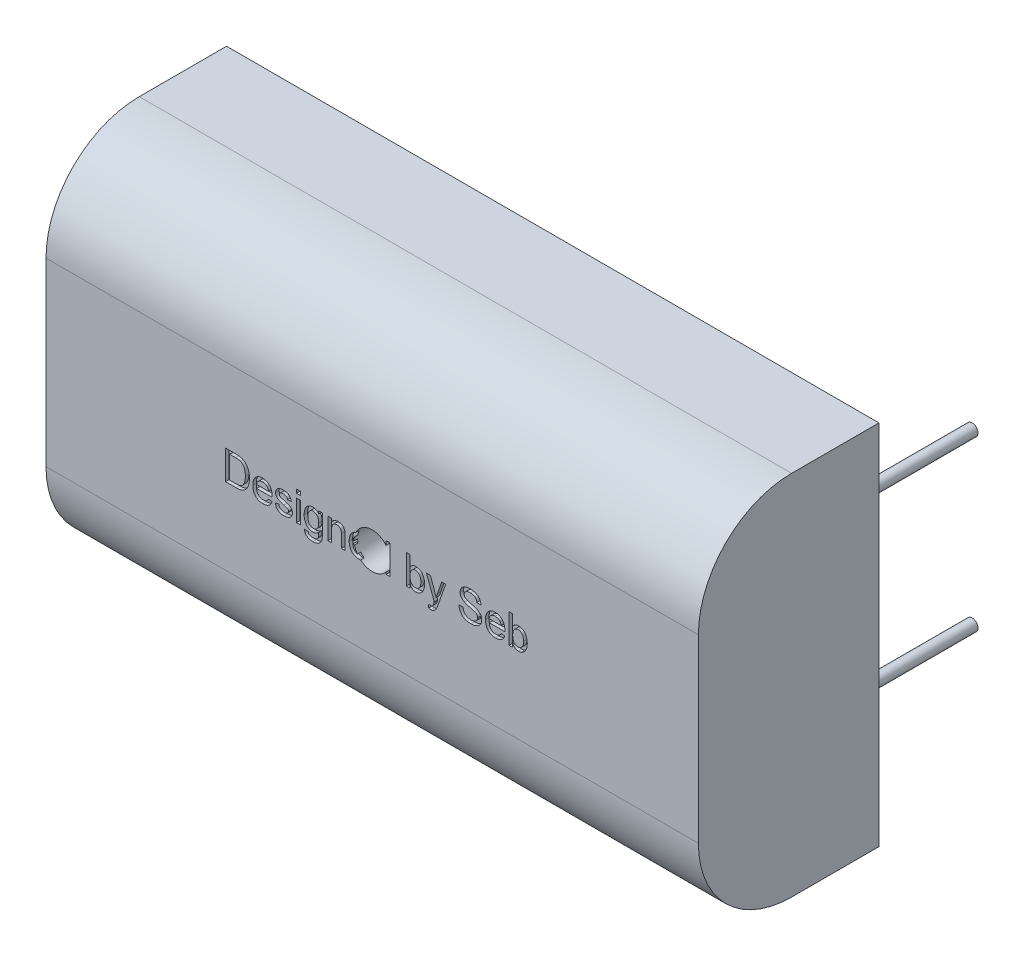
from build123d import *

# Parameters (mm, degrees)
SKETCH1_W           = 15.5
SKETCH1_H           = 31.5
BOSS_EXTRUDE1_DEPTH = 28
FILLET1_R           = 8
SKETCH2_R           = 0.5
BOSS_EXTRUDE2_DEPTH = 12
SKETCH3_W           = 0.32051282
SKETCH3_H           = 0.32051282
SKETCH3_H_2         = 1.826923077
CUT_EXTRUDE1_DEPTH  = 0.3
SKETCH4_R           = 1.55
CUT_EXTRUDE2_DEPTH  = 36.669489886


with BuildPart() as part:
    # Sketch1 → Boss-Extrude1 (new, symmetric)
    with BuildSketch(Plane(origin=(0, 0, 0), x_dir=(0, 0, -1), z_dir=(1, 0, 0))):
        Rectangle(SKETCH1_W, SKETCH1_H)
    extrude(amount=BOSS_EXTRUDE1_DEPTH, both=True)

    # Fillet1
    fillet1_edges = [part.edges().sort_by_distance(p)[0] for p in [
        (0, 15.75, 7.75),
        (0, -15.75, 7.75),
    ]]
    fillet(fillet1_edges, radius=FILLET1_R)

    # Sketch2 → Boss-Extrude2 (add)
    with BuildSketch(Plane(origin=(0, 0, -7.75), x_dir=(-1, 0, 0), z_dir=(0, 0, -1))):
        with Locations(Location((-24, 7.25, 0), (0, 0, 180))):
            Circle(SKETCH2_R)
        with Locations(Location((-24, -7.25, 0), (0, 0, 180))):
            Circle(SKETCH2_R)
    extrude(amount=BOSS_EXTRUDE2_DEPTH)

    # Sketch3 → Cut-Extrude1 (cut)
    # profile 1 of 14: a face of its own
    with BuildSketch(Plane.XY.offset(7.75)):
        with BuildLine():
            Line((-12.586012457, -1.161956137), (-12.586012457, 1.338043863))
            Line((-12.586012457, 1.338043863), (-11.731144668, 1.338043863))
            add(Edge.make_bspline(
                [(-11.731144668, 1.338043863), (-11.707773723, 1.337938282), (-11.662362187, 1.337733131), (-11.596397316, 1.336425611), (-11.534630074, 1.333271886), (-11.477345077, 1.329430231), (-11.424253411, 1.324315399), (-11.375422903, 1.318595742), (-11.330815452, 1.311135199), (-11.30277026, 1.304934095), (-11.289437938, 1.301986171)],
                knots=[0, 0, 0, 0, 1.263127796, 2.454354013, 3.565393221, 4.605443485, 5.557051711, 6.447822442, 7.26211484, 8, 8, 8, 8], degree=3))
            add(Edge.make_bspline(
                [(-11.289437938, 1.301986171), (-11.254958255, 1.292940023), (-11.18721955, 1.275167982), (-11.091599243, 1.235192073), (-11.003815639, 1.18504959), (-10.951754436, 1.143746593), (-10.925856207, 1.123200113)],
                knots=[0, 0, 0, 0, 1.04477941, 2.052571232, 3.03123721, 4, 4, 4, 4], degree=3))
            add(Edge.make_bspline(
                [(-10.925856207, 1.123200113), (-10.909776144, 1.109079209), (-10.877543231, 1.08077348), (-10.833271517, 1.034137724), (-10.792201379, 0.984664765), (-10.753106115, 0.933206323), (-10.718486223, 0.877886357), (-10.686034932, 0.820297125), (-10.657729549, 0.759282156), (-10.631674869, 0.695838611), (-10.608461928, 0.629719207), (-10.589388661, 0.560966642), (-10.571866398, 0.49029886), (-10.558833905, 0.416943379), (-10.547457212, 0.34152241), (-10.54023498, 0.263604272), (-10.535548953, 0.183421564), (-10.535005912, 0.129116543), (-10.534730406, 0.101565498)],
                knots=[0, 0, 0, 0, 0.908997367, 1.822109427, 2.728529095, 3.640759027, 4.565643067, 5.499218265, 6.448003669, 7.421473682, 8.413047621, 9.423472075, 10.452328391, 11.505545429, 12.587978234, 13.692612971, 14.829372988, 16, 16, 16, 16], degree=3))
            add(Edge.make_bspline(
                [(-10.534730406, 0.101565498), (-10.535401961, 0.055459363), (-10.536708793, -0.034262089), (-10.549632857, -0.164760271), (-10.56963175, -0.287424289), (-10.598737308, -0.401517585), (-10.634583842, -0.506407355), (-10.673689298, -0.60295026), (-10.718702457, -0.689482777), (-10.768080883, -0.766736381), (-10.820988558, -0.835199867), (-10.876415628, -0.895900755), (-10.934526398, -0.948865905), (-10.995025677, -0.995485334), (-11.061055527, -1.034087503), (-11.131923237, -1.068748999), (-11.209927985, -1.096599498), (-11.293600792, -1.120960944), (-11.383924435, -1.139211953), (-11.480409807, -1.152623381), (-11.583436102, -1.16073344), (-11.654173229, -1.161540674), (-11.690579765, -1.161956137)],
                knots=[0, 0, 0, 0, 1.410753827, 2.745293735, 4.009435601, 5.211453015, 6.344066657, 7.400119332, 8.396481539, 9.324811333, 10.202671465, 11.041621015, 11.837259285, 12.606727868, 13.374311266, 14.17412185, 15.017911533, 15.905707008, 16.839601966, 17.835295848, 18.885883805, 20, 20, 20, 20], degree=3))
            Line((-11.690579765, -1.161956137), (-12.586012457, -1.161956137))
        make_face()
        with BuildLine():
            Line((-12.233448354, -0.873494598), (-11.718123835, -0.873494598))
            add(Edge.make_bspline(
                [(-11.718123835, -0.873494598), (-11.680547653, -0.872932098), (-11.609461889, -0.871867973), (-11.5091711, -0.863695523), (-11.421640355, -0.849599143), (-11.34589903, -0.8295438), (-11.280181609, -0.803609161), (-11.222317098, -0.772948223), (-11.170845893, -0.738154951), (-11.141852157, -0.710318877), (-11.127679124, -0.696711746)],
                knots=[0, 0, 0, 0, 1.423649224, 2.693227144, 3.808972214, 4.778671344, 5.656058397, 6.479437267, 7.256702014, 8, 8, 8, 8], degree=3))
            add(Edge.make_bspline(
                [(-11.127679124, -0.696711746), (-11.109235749, -0.67562314), (-11.071346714, -0.632299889), (-11.024165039, -0.556616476), (-10.983020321, -0.471458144), (-10.948625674, -0.375918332), (-10.920422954, -0.27032019), (-10.901612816, -0.153717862), (-10.88931459, -0.02690419), (-10.887984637, 0.06130268), (-10.887294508, 0.107074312)],
                knots=[0, 0, 0, 0, 0.782184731, 1.606876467, 2.483531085, 3.422528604, 4.441347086, 5.534669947, 6.720709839, 8, 8, 8, 8], degree=3))
            add(Edge.make_bspline(
                [(-10.887294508, 0.107074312), (-10.887722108, 0.138963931), (-10.888553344, 0.200956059), (-10.893735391, 0.291268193), (-10.903965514, 0.375791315), (-10.917048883, 0.454671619), (-10.934912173, 0.527658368), (-10.955339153, 0.595450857), (-10.981036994, 0.65716287), (-11.010361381, 0.713270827), (-11.042530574, 0.764147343), (-11.076052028, 0.810885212), (-11.111097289, 0.853331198), (-11.14840894, 0.890881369), (-11.186865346, 0.924646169), (-11.227183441, 0.953934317), (-11.269250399, 0.978736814), (-11.298810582, 0.991611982), (-11.313476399, 0.997999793)],
                knots=[0, 0, 0, 0, 1.460126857, 2.838427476, 4.139102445, 5.35666337, 6.496721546, 7.577303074, 8.594995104, 9.55219858, 10.472533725, 11.348579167, 12.184287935, 12.989560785, 13.769667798, 14.524891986, 15.268148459, 16, 16, 16, 16], degree=3))
            add(Edge.make_bspline(
                [(-11.313476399, 0.997999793), (-11.324935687, 1.002193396), (-11.349217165, 1.011079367), (-11.388846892, 1.02113695), (-11.433074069, 1.030392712), (-11.482334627, 1.03688905), (-11.536379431, 1.043202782), (-11.595544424, 1.047039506), (-11.659519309, 1.048778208), (-11.703766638, 1.049308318), (-11.726637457, 1.049582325)],
                knots=[0, 0, 0, 0, 0.699400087, 1.48198292, 2.341906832, 3.289648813, 4.329964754, 5.462247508, 6.688271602, 8, 8, 8, 8], degree=3))
            Line((-11.726637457, 1.049582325), (-12.233448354, 1.049582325))
            Line((-12.233448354, 1.049582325), (-12.233448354, -0.873494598))
        make_face(mode=Mode.SUBTRACT)
    # profile 2 of 14: a face of its own
    with BuildSketch(Plane.XY.offset(7.75)):
        with BuildLine():
            Line((-8.90362063, -0.617084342), (-8.589618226, -0.649135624))
            add(Edge.make_bspline(
                [(-8.589618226, -0.649135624), (-8.59605652, -0.670315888), (-8.608721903, -0.71198161), (-8.634420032, -0.771076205), (-8.662658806, -0.827218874), (-8.696022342, -0.879186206), (-8.732630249, -0.928084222), (-8.773207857, -0.973522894), (-8.818642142, -1.014355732), (-8.867244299, -1.052287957), (-8.919823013, -1.085623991), (-8.975824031, -1.115055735), (-9.035452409, -1.139345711), (-9.098537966, -1.15958062), (-9.165224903, -1.175013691), (-9.2353895, -1.18567556), (-9.308939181, -1.193229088), (-9.359162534, -1.193743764), (-9.384890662, -1.194007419)],
                knots=[0, 0, 0, 0, 1.017198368, 2.001028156, 2.958938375, 3.904526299, 4.836491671, 5.766019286, 6.700699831, 7.641977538, 8.598163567, 9.559604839, 10.547559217, 11.555094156, 12.60347703, 13.691418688, 14.817373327, 16, 16, 16, 16], degree=3))
            add(Edge.make_bspline(
                [(-9.384890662, -1.194007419), (-9.417146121, -1.19324943), (-9.480034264, -1.191771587), (-9.571874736, -1.179915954), (-9.658625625, -1.161161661), (-9.740475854, -1.134590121), (-9.816900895, -1.09996254), (-9.888094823, -1.057374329), (-9.954500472, -1.007809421), (-10.015161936, -0.950394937), (-10.070046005, -0.886405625), (-10.116919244, -0.815255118), (-10.157571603, -0.738648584), (-10.189903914, -0.655341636), (-10.215459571, -0.566168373), (-10.233191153, -0.470749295), (-10.244535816, -0.369462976), (-10.245681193, -0.299775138), (-10.246268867, -0.264019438)],
                knots=[0, 0, 0, 0, 1.077616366, 2.10101772, 3.089143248, 4.040031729, 4.971276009, 5.886882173, 6.807369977, 7.734796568, 8.672701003, 9.618074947, 10.576315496, 11.565652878, 12.598619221, 13.67195277, 14.805516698, 16, 16, 16, 16], degree=3))
            add(Edge.make_bspline(
                [(-10.246268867, -0.264019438), (-10.245675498, -0.226931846), (-10.244523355, -0.154919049), (-10.233324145, -0.050068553), (-10.214802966, 0.048375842), (-10.189670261, 0.140771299), (-10.156367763, 0.226671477), (-10.115732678, 0.306045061), (-10.068016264, 0.379321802), (-10.012757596, 0.445428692), (-9.951613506, 0.504213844), (-9.886526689, 0.556486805), (-9.816131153, 0.599625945), (-9.741865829, 0.635443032), (-9.663014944, 0.662961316), (-9.580064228, 0.683227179), (-9.492382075, 0.69466265), (-9.432498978, 0.69622193), (-9.401917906, 0.697018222)],
                knots=[0, 0, 0, 0, 1.232307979, 2.392766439, 3.499416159, 4.558769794, 5.570548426, 6.555643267, 7.517416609, 8.470735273, 9.412423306, 10.33263532, 11.239503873, 12.150233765, 13.067967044, 14.009932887, 14.983713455, 16, 16, 16, 16], degree=3))
            add(Edge.make_bspline(
                [(-9.401917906, 0.697018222), (-9.372329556, 0.696257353), (-9.314424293, 0.69476831), (-9.229591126, 0.682817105), (-9.148755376, 0.66414133), (-9.072086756, 0.637015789), (-8.999971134, 0.601408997), (-8.931629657, 0.55891147), (-8.867539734, 0.508293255), (-8.808112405, 0.450244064), (-8.753965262, 0.385415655), (-8.707127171, 0.313556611), (-8.66746696, 0.235677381), (-8.635316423, 0.151182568), (-8.610568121, 0.060559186), (-8.592638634, -0.036252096), (-8.581331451, -0.139218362), (-8.580189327, -0.21006937), (-8.5796022, -0.246491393)],
                knots=[0, 0, 0, 0, 1.005323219, 1.967446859, 2.906060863, 3.821317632, 4.724696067, 5.63467896, 6.55185077, 7.494776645, 8.453732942, 9.416859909, 10.403972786, 11.418730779, 12.484189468, 13.592581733, 14.76243057, 16, 16, 16, 16], degree=3))
            add(Edge.make_bspline(
                [(-8.5796022, -0.246491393), (-8.57975472, -0.257843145), (-8.580122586, -0.285222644), (-8.580742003, -0.312597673), (-8.581104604, -0.328622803)],
                knots=[0, 0, 0, 0, 0.829215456, 2, 2, 2, 2], degree=3))
            Line((-8.581104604, -0.328622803), (-9.925756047, -0.328622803))
            add(Edge.make_bspline(
                [(-9.925756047, -0.328622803), (-9.923900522, -0.351195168), (-9.920270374, -0.395355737), (-9.909684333, -0.459292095), (-9.895398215, -0.519379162), (-9.876167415, -0.575087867), (-9.853449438, -0.62704213), (-9.825373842, -0.674387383), (-9.79409524, -0.718175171), (-9.758156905, -0.757337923), (-9.719372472, -0.792172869), (-9.677868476, -0.822730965), (-9.63371852, -0.848076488), (-9.587561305, -0.869383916), (-9.538965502, -0.885417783), (-9.488152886, -0.896892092), (-9.434839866, -0.904070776), (-9.398435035, -0.905047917), (-9.379882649, -0.90554588)],
                knots=[0, 0, 0, 0, 1.224729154, 2.396059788, 3.502114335, 4.561587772, 5.580251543, 6.563724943, 7.533714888, 8.486186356, 9.43260269, 10.350144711, 11.268619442, 12.181885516, 13.095687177, 14.031096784, 14.996620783, 16, 16, 16, 16], degree=3))
            add(Edge.make_bspline(
                [(-9.379882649, -0.90554588), (-9.35279485, -0.904638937), (-9.300318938, -0.902881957), (-9.224600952, -0.890555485), (-9.155193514, -0.868821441), (-9.091608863, -0.838651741), (-9.03395251, -0.798659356), (-8.983642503, -0.747469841), (-8.938913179, -0.686801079), (-8.915648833, -0.640844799), (-8.90362063, -0.617084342)],
                knots=[0, 0, 0, 0, 1.096312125, 2.123833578, 3.094060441, 4.030938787, 4.962563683, 5.918139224, 6.923629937, 8, 8, 8, 8], degree=3))
        make_face()
        with BuildLine():
            Line((-9.925756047, -0.040161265), (-8.900115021, -0.040161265))
            add(Edge.make_bspline(
                [(-8.900115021, -0.040161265), (-8.902132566, -0.024280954), (-8.906077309, 0.006768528), (-8.914380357, 0.051677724), (-8.925453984, 0.093519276), (-8.938790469, 0.132136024), (-8.955053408, 0.167601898), (-8.973427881, 0.199971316), (-8.993959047, 0.229589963), (-9.009915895, 0.24680309), (-9.017803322, 0.255311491)],
                knots=[0, 0, 0, 0, 1.185316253, 2.317552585, 3.379013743, 4.387694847, 5.339152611, 6.263729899, 7.141766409, 8, 8, 8, 8], degree=3))
            add(Edge.make_bspline(
                [(-9.017803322, 0.255311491), (-9.030405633, 0.267611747), (-9.05529735, 0.291906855), (-9.096798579, 0.323224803), (-9.141400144, 0.349196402), (-9.188234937, 0.371605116), (-9.238350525, 0.387839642), (-9.290743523, 0.400103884), (-9.346143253, 0.407051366), (-9.384037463, 0.408047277), (-9.403420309, 0.408556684)],
                knots=[0, 0, 0, 0, 0.989486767, 1.954405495, 2.91383024, 3.888017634, 4.867526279, 5.869356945, 6.910178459, 8, 8, 8, 8], degree=3))
            add(Edge.make_bspline(
                [(-9.403420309, 0.408556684), (-9.420963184, 0.408149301), (-9.455302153, 0.407351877), (-9.50589101, 0.401740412), (-9.554377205, 0.392438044), (-9.60067479, 0.378636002), (-9.644952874, 0.361861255), (-9.686900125, 0.340417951), (-9.726810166, 0.315501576), (-9.764524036, 0.287000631), (-9.798641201, 0.255060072), (-9.829841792, 0.221036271), (-9.855672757, 0.183432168), (-9.878575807, 0.143999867), (-9.89650905, 0.10150874), (-9.910626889, 0.056584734), (-9.920676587, 0.009104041), (-9.924047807, -0.023593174), (-9.925756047, -0.040161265)],
                knots=[0, 0, 0, 0, 1.10270868, 2.158476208, 3.195774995, 4.201977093, 5.192014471, 6.168217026, 7.158254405, 8.146844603, 9.134487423, 10.093158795, 11.042305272, 11.996428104, 12.955501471, 13.934632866, 14.95345241, 16, 16, 16, 16], degree=3))
        make_face(mode=Mode.SUBTRACT)
    # profile 3 of 14: a face of its own
    with BuildSketch(Plane.XY.offset(7.75)):
        with BuildLine():
            Line((-8.323191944, -0.58503306), (-8.002679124, -0.552981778))
            add(Edge.make_bspline(
                [(-8.002679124, -0.552981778), (-7.997783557, -0.58010601), (-7.988407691, -0.632053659), (-7.959611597, -0.70364509), (-7.920759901, -0.765562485), (-7.878911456, -0.808694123), (-7.839991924, -0.836482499), (-7.80833894, -0.855351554), (-7.773543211, -0.870589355), (-7.736455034, -0.883772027), (-7.696544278, -0.893761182), (-7.653828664, -0.90070218), (-7.608287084, -0.904594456), (-7.577005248, -0.905223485), (-7.560972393, -0.90554588)],
                knots=[0, 0, 0, 0, 1.576426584, 3.019132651, 4.39139761, 5.744583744, 6.429748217, 7.128801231, 7.852561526, 8.603024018, 9.382742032, 10.206978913, 11.081024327, 12, 12, 12, 12], degree=3))
            add(Edge.make_bspline(
                [(-7.560972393, -0.90554588), (-7.544935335, -0.905462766), (-7.513807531, -0.905301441), (-7.468860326, -0.900958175), (-7.426999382, -0.895184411), (-7.388416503, -0.886838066), (-7.353192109, -0.875602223), (-7.320697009, -0.862869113), (-7.291771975, -0.846767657), (-7.258238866, -0.823145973), (-7.223664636, -0.789691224), (-7.192097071, -0.74531526), (-7.172704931, -0.696533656), (-7.17046938, -0.662656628), (-7.16934579, -0.645630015)],
                knots=[0, 0, 0, 0, 1.101207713, 2.137435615, 3.099211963, 4.003546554, 4.845050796, 5.637285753, 6.396976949, 7.112904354, 8.451176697, 9.67915534, 10.8335422, 12, 12, 12, 12], degree=3))
            add(Edge.make_bspline(
                [(-7.16934579, -0.645630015), (-7.16952671, -0.637909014), (-7.169881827, -0.622753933), (-7.175880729, -0.60103865), (-7.184403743, -0.580514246), (-7.196702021, -0.561309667), (-7.212282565, -0.543349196), (-7.231271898, -0.526487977), (-7.253707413, -0.511126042), (-7.270408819, -0.502395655), (-7.279021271, -0.497893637)],
                knots=[0, 0, 0, 0, 0.948511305, 1.861774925, 2.756066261, 3.680846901, 4.658374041, 5.678500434, 6.80286706, 8, 8, 8, 8], degree=3))
            add(Edge.make_bspline(
                [(-7.279021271, -0.497893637), (-7.286165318, -0.494639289), (-7.301775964, -0.487528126), (-7.328037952, -0.477858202), (-7.35851111, -0.466439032), (-7.394049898, -0.456015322), (-7.433865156, -0.44374757), (-7.478301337, -0.430539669), (-7.527771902, -0.418002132), (-7.562148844, -0.408946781), (-7.580002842, -0.404243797)],
                knots=[0, 0, 0, 0, 0.596822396, 1.30413245, 2.127382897, 3.071041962, 4.119245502, 5.296370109, 6.595843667, 8, 8, 8, 8], degree=3))
            add(Edge.make_bspline(
                [(-7.580002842, -0.404243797), (-7.604387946, -0.3971088), (-7.651377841, -0.383359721), (-7.718988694, -0.362823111), (-7.781454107, -0.343217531), (-7.838814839, -0.324455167), (-7.890805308, -0.305801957), (-7.937684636, -0.288427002), (-7.979134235, -0.271244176), (-8.027211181, -0.250730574), (-8.080115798, -0.22186774), (-8.136081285, -0.181141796), (-8.183442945, -0.133609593), (-8.222732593, -0.080801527), (-8.253573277, -0.023436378), (-8.274921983, 0.037620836), (-8.288570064, 0.101466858), (-8.290275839, 0.145065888), (-8.291140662, 0.167170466)],
                knots=[0, 0, 0, 0, 1.22605552, 2.362598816, 3.409724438, 4.385374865, 5.274589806, 6.075051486, 6.797583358, 7.439654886, 8.596878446, 9.697305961, 10.768176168, 11.821850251, 12.863383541, 13.897821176, 14.934201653, 16, 16, 16, 16], degree=3))
            add(Edge.make_bspline(
                [(-8.291140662, 0.167170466), (-8.290447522, 0.187245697), (-8.289075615, 0.22697989), (-8.278729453, 0.285299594), (-8.262253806, 0.341563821), (-8.238464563, 0.39501461), (-8.209322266, 0.445451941), (-8.174115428, 0.491156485), (-8.135390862, 0.533467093), (-8.105362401, 0.557016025), (-8.090319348, 0.568813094)],
                knots=[0, 0, 0, 0, 1.034021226, 2.046601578, 3.042752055, 4.048071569, 5.054273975, 6.036661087, 7.016446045, 8, 8, 8, 8], degree=3))
            add(Edge.make_bspline(
                [(-8.090319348, 0.568813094), (-8.077781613, 0.577560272), (-8.051512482, 0.595887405), (-8.007115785, 0.619868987), (-7.956165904, 0.641191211), (-7.899750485, 0.660294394), (-7.839210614, 0.677104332), (-7.775630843, 0.688197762), (-7.710049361, 0.695560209), (-7.665660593, 0.696526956), (-7.643103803, 0.697018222)],
                knots=[0, 0, 0, 0, 0.776203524, 1.626305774, 2.557252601, 3.57906176, 4.650888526, 5.745456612, 6.854321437, 8, 8, 8, 8], degree=3))
            add(Edge.make_bspline(
                [(-7.643103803, 0.697018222), (-7.609518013, 0.696246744), (-7.544309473, 0.694748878), (-7.449695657, 0.68325732), (-7.3614973, 0.663694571), (-7.280182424, 0.63702761), (-7.207053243, 0.603685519), (-7.143000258, 0.564868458), (-7.089810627, 0.519302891), (-7.045937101, 0.467967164), (-7.010758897, 0.409072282), (-6.982604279, 0.342035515), (-6.959967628, 0.266259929), (-6.950128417, 0.212362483), (-6.944986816, 0.184197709)],
                knots=[0, 0, 0, 0, 1.253394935, 2.433530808, 3.550681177, 4.620594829, 5.621516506, 6.544862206, 7.406547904, 8.22431151, 9.054607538, 9.956211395, 10.931993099, 12, 12, 12, 12], degree=3))
            Line((-6.944986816, 0.184197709), (-7.265499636, 0.152146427))
            add(Edge.make_bspline(
                [(-7.265499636, 0.152146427), (-7.269312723, 0.171369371), (-7.276711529, 0.208669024), (-7.299112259, 0.260301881), (-7.330921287, 0.304750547), (-7.371317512, 0.342480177), (-7.420461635, 0.372978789), (-7.479203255, 0.393644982), (-7.546356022, 0.406895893), (-7.594288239, 0.407983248), (-7.619566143, 0.408556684)],
                knots=[0, 0, 0, 0, 0.971549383, 1.88516682, 2.771115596, 3.668786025, 4.614654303, 5.622170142, 6.746009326, 8, 8, 8, 8], degree=3))
            add(Edge.make_bspline(
                [(-7.619566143, 0.408556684), (-7.634761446, 0.408375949), (-7.664015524, 0.408027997), (-7.706327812, 0.405057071), (-7.745226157, 0.399923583), (-7.781051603, 0.393904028), (-7.813050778, 0.384588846), (-7.842151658, 0.374360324), (-7.867543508, 0.361263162), (-7.89634125, 0.342502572), (-7.92499528, 0.315339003), (-7.951773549, 0.280063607), (-7.967745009, 0.24070372), (-7.969667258, 0.213377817), (-7.970627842, 0.199722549)],
                knots=[0, 0, 0, 0, 1.202032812, 2.314159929, 3.352655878, 4.305866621, 5.183839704, 5.986040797, 6.742017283, 7.437935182, 8.699432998, 9.843179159, 10.922196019, 12, 12, 12, 12], degree=3))
            add(Edge.make_bspline(
                [(-7.970627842, 0.199722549), (-7.970305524, 0.190994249), (-7.969669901, 0.173781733), (-7.962710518, 0.148937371), (-7.95214452, 0.125370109), (-7.942166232, 0.111266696), (-7.937074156, 0.104069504)],
                knots=[0, 0, 0, 0, 1.012137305, 1.99597066, 2.977312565, 4, 4, 4, 4], degree=3))
            add(Edge.make_bspline(
                [(-7.937074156, 0.104069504), (-7.930968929, 0.096814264), (-7.918264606, 0.081716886), (-7.893384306, 0.062933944), (-7.864433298, 0.045283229), (-7.842725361, 0.035864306), (-7.831405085, 0.030952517)],
                knots=[0, 0, 0, 0, 0.873299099, 1.81724178, 2.861733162, 4, 4, 4, 4], degree=3))
            add(Edge.make_bspline(
                [(-7.831405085, 0.030952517), (-7.827073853, 0.029422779), (-7.816967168, 0.025853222), (-7.799032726, 0.020391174), (-7.776374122, 0.013400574), (-7.748439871, 0.005407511), (-7.715766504, -0.004099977), (-7.677820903, -0.014602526), (-7.63513014, -0.026614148), (-7.604882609, -0.034843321), (-7.589017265, -0.039159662)],
                knots=[0, 0, 0, 0, 0.436802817, 1.019254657, 1.782618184, 2.69198815, 3.782349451, 5.018834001, 6.436327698, 8, 8, 8, 8], degree=3))
            add(Edge.make_bspline(
                [(-7.589017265, -0.039159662), (-7.565465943, -0.046293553), (-7.519984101, -0.06007038), (-7.454108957, -0.080811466), (-7.392778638, -0.100138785), (-7.336170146, -0.118627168), (-7.284321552, -0.136360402), (-7.236983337, -0.152619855), (-7.194294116, -0.168292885), (-7.144221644, -0.187055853), (-7.087334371, -0.212338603), (-7.02697717, -0.250675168), (-6.974070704, -0.295187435), (-6.929176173, -0.345911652), (-6.89269817, -0.403271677), (-6.867431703, -0.46770865), (-6.851267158, -0.538334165), (-6.849662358, -0.587610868), (-6.84883297, -0.613077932)],
                knots=[0, 0, 0, 0, 1.155996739, 2.232437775, 3.244329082, 4.176768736, 5.029854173, 5.818511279, 6.528027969, 7.165934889, 8.330913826, 9.444808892, 10.513164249, 11.568838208, 12.615385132, 13.688622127, 14.805439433, 16, 16, 16, 16], degree=3))
            add(Edge.make_bspline(
                [(-6.84883297, -0.613077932), (-6.849871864, -0.638712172), (-6.85194434, -0.689849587), (-6.869362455, -0.765012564), (-6.896531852, -0.83815543), (-6.9350979, -0.90775972), (-6.983626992, -0.972824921), (-7.042885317, -1.030280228), (-7.112007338, -1.079829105), (-7.190054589, -1.120760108), (-7.275243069, -1.154240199), (-7.366965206, -1.176408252), (-7.463791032, -1.191953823), (-7.530357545, -1.193311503), (-7.564478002, -1.194007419)],
                knots=[0, 0, 0, 0, 0.894809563, 1.785044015, 2.682170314, 3.614214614, 4.555721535, 5.508634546, 6.486485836, 7.51727745, 8.581064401, 9.676123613, 10.808834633, 12, 12, 12, 12], degree=3))
            add(Edge.make_bspline(
                [(-7.564478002, -1.194007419), (-7.592537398, -1.1935129), (-7.646911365, -1.192554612), (-7.72591291, -1.185573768), (-7.799778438, -1.173718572), (-7.868455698, -1.156759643), (-7.931982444, -1.135190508), (-7.990539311, -1.109229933), (-8.043998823, -1.078052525), (-8.092332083, -1.041840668), (-8.135853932, -1.000569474), (-8.175457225, -0.955084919), (-8.210695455, -0.904713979), (-8.241121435, -0.849580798), (-8.2684016, -0.790268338), (-8.291313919, -0.726096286), (-8.30988986, -0.657226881), (-8.318687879, -0.609477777), (-8.323191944, -0.58503306)],
                knots=[0, 0, 0, 0, 1.244406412, 2.411431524, 3.514215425, 4.559320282, 5.545040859, 6.48623969, 7.395443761, 8.283912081, 9.158607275, 10.050831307, 10.954592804, 11.879399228, 12.840196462, 13.8472361, 14.897912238, 16, 16, 16, 16], degree=3))
        make_face()
    # profile 4 of 14: a face of its own
    with BuildSketch(Plane.XY.offset(7.75)):
        with Locations((-6.336012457, 1.177787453)):
            Rectangle(SKETCH3_W, SKETCH3_H)
    # profile 5 of 14: a face of its own
    with BuildSketch(Plane.XY.offset(7.75)):
        with Locations((-6.336012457, -0.248494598)):
            Rectangle(SKETCH3_W, SKETCH3_H_2)
    # profile 6 of 14: a face of its own
    with BuildSketch(Plane.XY.offset(7.75)):
        with BuildLine():
            Line((-5.811172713, -1.290161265), (-5.490659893, -1.322212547))
            add(Edge.make_bspline(
                [(-5.490659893, -1.322212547), (-5.487121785, -1.341650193), (-5.480372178, -1.378731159), (-5.457939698, -1.428576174), (-5.429118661, -1.471668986), (-5.402652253, -1.492264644), (-5.389498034, -1.502501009)],
                knots=[0, 0, 0, 0, 1.110696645, 2.118862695, 3.065045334, 4, 4, 4, 4], degree=3))
            add(Edge.make_bspline(
                [(-5.389498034, -1.502501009), (-5.369652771, -1.514259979), (-5.32836162, -1.538726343), (-5.256329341, -1.562020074), (-5.174702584, -1.575920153), (-5.116959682, -1.577689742), (-5.086513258, -1.578622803)],
                knots=[0, 0, 0, 0, 0.871695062, 1.813696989, 2.847215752, 4, 4, 4, 4], degree=3))
            add(Edge.make_bspline(
                [(-5.086513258, -1.578622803), (-5.069806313, -1.578553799), (-5.037174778, -1.578419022), (-4.989955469, -1.573815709), (-4.945318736, -1.568953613), (-4.903962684, -1.560040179), (-4.865011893, -1.550058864), (-4.829690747, -1.536044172), (-4.796528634, -1.521465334), (-4.757649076, -1.497277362), (-4.714367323, -1.461966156), (-4.670538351, -1.412064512), (-4.636850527, -1.353651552), (-4.622235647, -1.310987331), (-4.61475845, -1.289159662)],
                knots=[0, 0, 0, 0, 1.001026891, 1.95517755, 2.8427591, 3.690690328, 4.48947297, 5.249706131, 5.966189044, 6.657918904, 7.988115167, 9.300572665, 10.618931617, 12, 12, 12, 12], degree=3))
            add(Edge.make_bspline(
                [(-4.61475845, -1.289159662), (-4.612791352, -1.281172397), (-4.608440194, -1.263504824), (-4.604437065, -1.233791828), (-4.600201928, -1.198598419), (-4.597553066, -1.157466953), (-4.59490208, -1.110569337), (-4.593507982, -1.057964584), (-4.593141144, -0.999697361), (-4.593195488, -0.958964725), (-4.593223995, -0.937597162)],
                knots=[0, 0, 0, 0, 0.558973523, 1.23643144, 2.036175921, 2.969448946, 4.037954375, 5.230299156, 6.547067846, 8, 8, 8, 8], degree=3))
            add(Edge.make_bspline(
                [(-4.593223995, -0.937597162), (-4.609718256, -0.955499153), (-4.642114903, -0.990660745), (-4.696147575, -1.036139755), (-4.752571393, -1.075387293), (-4.812501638, -1.10697238), (-4.875485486, -1.131715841), (-4.941519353, -1.149188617), (-5.010533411, -1.160031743), (-5.057593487, -1.161307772), (-5.081505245, -1.161956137)],
                knots=[0, 0, 0, 0, 1.051596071, 2.065457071, 3.046490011, 4.018372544, 4.987463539, 5.966183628, 6.966594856, 8, 8, 8, 8], degree=3))
            add(Edge.make_bspline(
                [(-5.081505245, -1.161956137), (-5.110942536, -1.161326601), (-5.168454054, -1.16009668), (-5.252000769, -1.146411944), (-5.330657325, -1.125835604), (-5.404078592, -1.095795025), (-5.47258574, -1.057768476), (-5.535509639, -1.010717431), (-5.593323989, -0.955365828), (-5.645133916, -0.892082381), (-5.691423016, -0.823048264), (-5.732074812, -0.750174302), (-5.767053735, -0.674008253), (-5.794069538, -0.593886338), (-5.816636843, -0.511056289), (-5.831738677, -0.424544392), (-5.84170724, -0.334867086), (-5.842713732, -0.273896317), (-5.843223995, -0.242985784)],
                knots=[0, 0, 0, 0, 1.053905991, 2.05901193, 3.025421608, 3.961855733, 4.893808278, 5.825799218, 6.769295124, 7.755025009, 8.750490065, 9.744030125, 10.742581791, 11.74900413, 12.770513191, 13.815982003, 14.892761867, 16, 16, 16, 16], degree=3))
            add(Edge.make_bspline(
                [(-5.843223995, -0.242985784), (-5.842260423, -0.200354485), (-5.840363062, -0.116409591), (-5.82255191, 0.006597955), (-5.795331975, 0.124822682), (-5.762630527, 0.218909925), (-5.731411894, 0.290505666), (-5.705338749, 0.340993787), (-5.676116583, 0.387901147), (-5.645103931, 0.432247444), (-5.611611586, 0.473403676), (-5.57530662, 0.511117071), (-5.536633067, 0.54575309), (-5.495608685, 0.577475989), (-5.452017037, 0.605249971), (-5.406883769, 0.63016908), (-5.359481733, 0.650571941), (-5.310505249, 0.66773724), (-5.259519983, 0.680653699), (-5.20684347, 0.690303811), (-5.152232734, 0.69574888), (-5.115237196, 0.696591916), (-5.096529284, 0.697018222)],
                knots=[0, 0, 0, 0, 1.897475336, 3.736300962, 5.523301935, 7.293648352, 8.162460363, 9.000380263, 9.82151075, 10.621780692, 11.408995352, 12.181898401, 12.950535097, 13.719279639, 14.488455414, 15.250267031, 16.0126588, 16.783807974, 17.559138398, 18.352402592, 19.166842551, 20, 20, 20, 20], degree=3))
            add(Edge.make_bspline(
                [(-5.096529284, 0.697018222), (-5.071607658, 0.696267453), (-5.022468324, 0.694787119), (-4.950648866, 0.682515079), (-4.882215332, 0.662346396), (-4.817183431, 0.634002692), (-4.755274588, 0.597955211), (-4.697369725, 0.553074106), (-4.642273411, 0.501004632), (-4.609813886, 0.461035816), (-4.593223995, 0.440607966)],
                knots=[0, 0, 0, 0, 1.01929062, 2.009791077, 2.971609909, 3.932263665, 4.905848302, 5.895028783, 6.924160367, 8, 8, 8, 8], degree=3))
            Line((-4.593223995, 0.440607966), (-4.593223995, 0.66496694))
            Line((-4.593223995, 0.66496694), (-4.272711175, 0.66496694))
            Line((-4.272711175, 0.66496694), (-4.272711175, -0.892024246))
            add(Edge.make_bspline(
                [(-4.272711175, -0.892024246), (-4.273012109, -0.925749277), (-4.273591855, -0.990720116), (-4.277640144, -1.084415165), (-4.283892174, -1.170641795), (-4.293115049, -1.249246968), (-4.305853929, -1.32002794), (-4.319943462, -1.383424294), (-4.337097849, -1.439241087), (-4.358219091, -1.487765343), (-4.381782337, -1.531441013), (-4.408410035, -1.571731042), (-4.437425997, -1.610271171), (-4.470348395, -1.645905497), (-4.50630284, -1.679443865), (-4.545670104, -1.710488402), (-4.587689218, -1.739654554), (-4.632946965, -1.766133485), (-4.680799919, -1.790279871), (-4.731805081, -1.810753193), (-4.785290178, -1.82835204), (-4.841751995, -1.842260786), (-4.900787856, -1.853235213), (-4.962483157, -1.861122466), (-5.02682563, -1.866412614), (-5.070643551, -1.866857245), (-5.093023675, -1.867084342)],
                knots=[0, 0, 0, 0, 1.64197855, 3.163250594, 4.565204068, 5.850564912, 7.014446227, 8.065312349, 9.01127449, 9.852247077, 10.63778093, 11.424533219, 12.201569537, 12.983943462, 13.783315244, 14.593155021, 15.422818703, 16.271726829, 17.144084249, 18.030041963, 18.945050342, 19.883369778, 20.85896591, 21.867096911, 22.910613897, 24, 24, 24, 24], degree=3))
            add(Edge.make_bspline(
                [(-5.093023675, -1.867084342), (-5.119419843, -1.866818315), (-5.171142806, -1.86629704), (-5.246680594, -1.858743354), (-5.318470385, -1.848407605), (-5.386077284, -1.831797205), (-5.450064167, -1.812241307), (-5.510235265, -1.787696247), (-5.565853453, -1.757696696), (-5.618070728, -1.724700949), (-5.665082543, -1.686474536), (-5.705763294, -1.643435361), (-5.739862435, -1.595513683), (-5.767374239, -1.543278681), (-5.788699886, -1.486432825), (-5.80295609, -1.424996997), (-5.811154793, -1.358998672), (-5.811166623, -1.313555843), (-5.811172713, -1.290161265)],
                knots=[0, 0, 0, 0, 1.208388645, 2.367822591, 3.474003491, 4.527319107, 5.552625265, 6.53656117, 7.497656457, 8.443516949, 9.36178258, 10.265029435, 11.147589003, 12.047074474, 12.961608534, 13.920359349, 14.929373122, 16, 16, 16, 16], degree=3))
        make_face()
        with BuildLine():
            add(Edge.make_bspline(
                [(-5.522711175, -0.220950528), (-5.522419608, -0.248345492), (-5.521855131, -0.301382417), (-5.514911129, -0.377910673), (-5.505516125, -0.448824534), (-5.490784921, -0.513737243), (-5.472597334, -0.573274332), (-5.449433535, -0.626820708), (-5.422996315, -0.675227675), (-5.39172169, -0.7172708), (-5.357497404, -0.753905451), (-5.321129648, -0.785850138), (-5.282569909, -0.813009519), (-5.241853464, -0.835061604), (-5.199262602, -0.852506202), (-5.154283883, -0.864275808), (-5.107319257, -0.872119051), (-5.07519387, -0.87303301), (-5.058969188, -0.873494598)],
                knots=[0, 0, 0, 0, 1.45632428, 2.819458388, 4.083699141, 5.257462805, 6.355283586, 7.389222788, 8.354942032, 9.281768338, 10.167418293, 11.01672946, 11.851628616, 12.669938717, 13.474408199, 14.2927183, 15.137750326, 16, 16, 16, 16], degree=3))
            add(Edge.make_bspline(
                [(-5.058969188, -0.873494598), (-5.042757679, -0.872965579), (-5.010848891, -0.871924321), (-4.963996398, -0.865132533), (-4.919497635, -0.852131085), (-4.876806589, -0.835184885), (-4.83590604, -0.813501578), (-4.797151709, -0.786902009), (-4.760935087, -0.75474376), (-4.726346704, -0.71837275), (-4.694481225, -0.676770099), (-4.66736939, -0.628989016), (-4.64461987, -0.575805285), (-4.625408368, -0.517381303), (-4.611186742, -0.453430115), (-4.60083288, -0.384150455), (-4.594133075, -0.309389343), (-4.593533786, -0.257691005), (-4.593223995, -0.230966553)],
                knots=[0, 0, 0, 0, 0.870520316, 1.713427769, 2.533340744, 3.35384133, 4.175760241, 5.013553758, 5.871011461, 6.771289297, 7.705201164, 8.676799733, 9.712428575, 10.806445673, 11.973986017, 13.225054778, 14.565545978, 16, 16, 16, 16], degree=3))
            add(Edge.make_bspline(
                [(-4.593223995, -0.230966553), (-4.593544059, -0.205244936), (-4.594162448, -0.155548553), (-4.600732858, -0.083404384), (-4.611817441, -0.016178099), (-4.626361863, 0.046485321), (-4.646226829, 0.104017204), (-4.66950721, 0.156935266), (-4.697653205, 0.204907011), (-4.730316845, 0.247464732), (-4.766100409, 0.284789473), (-4.802849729, 0.318209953), (-4.842028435, 0.345921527), (-4.882525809, 0.369366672), (-4.92542625, 0.386785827), (-4.969905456, 0.39944774), (-5.016133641, 0.407144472), (-5.04758878, 0.408082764), (-5.063476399, 0.408556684)],
                knots=[0, 0, 0, 0, 1.387266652, 2.680318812, 3.903168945, 5.060782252, 6.145785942, 7.181734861, 8.174799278, 9.138396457, 10.068419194, 10.961341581, 11.813462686, 12.65229968, 13.480091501, 14.303906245, 15.143323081, 16, 16, 16, 16], degree=3))
            add(Edge.make_bspline(
                [(-5.063476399, 0.408556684), (-5.079197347, 0.408088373), (-5.110156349, 0.407166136), (-5.155569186, 0.399476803), (-5.198938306, 0.386688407), (-5.241037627, 0.369790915), (-5.280898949, 0.346913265), (-5.31955241, 0.319859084), (-5.35533741, 0.286759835), (-5.390125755, 0.24994563), (-5.421851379, 0.207900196), (-5.448687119, 0.160384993), (-5.471900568, 0.108648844), (-5.490383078, 0.0518625), (-5.50470183, -0.009656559), (-5.515044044, -0.075941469), (-5.521804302, -0.146859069), (-5.522402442, -0.1957271), (-5.522711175, -0.220950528)],
                knots=[0, 0, 0, 0, 0.863270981, 1.700025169, 2.521359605, 3.3439219, 4.185686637, 5.040685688, 5.930250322, 6.858130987, 7.821061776, 8.815234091, 9.849744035, 10.93146729, 12.09040003, 13.316165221, 14.614728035, 16, 16, 16, 16], degree=3))
        make_face(mode=Mode.SUBTRACT)
    # profile 7 of 14: a face of its own
    with BuildSketch(Plane.XY.offset(7.75)):
        with BuildLine():
            Line((-3.803961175, -1.161956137), (-3.803961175, 0.66496694))
            Line((-3.803961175, 0.66496694), (-3.483448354, 0.66496694))
            Line((-3.483448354, 0.66496694), (-3.483448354, 0.410059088))
            add(Edge.make_bspline(
                [(-3.483448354, 0.410059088), (-3.466923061, 0.43282696), (-3.434504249, 0.477492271), (-3.378098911, 0.5366244), (-3.315770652, 0.585930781), (-3.248833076, 0.627254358), (-3.175738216, 0.658206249), (-3.097609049, 0.680835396), (-3.01401176, 0.694575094), (-2.956490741, 0.696191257), (-2.92705813, 0.697018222)],
                knots=[0, 0, 0, 0, 1.031609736, 2.02378021, 2.987167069, 3.941100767, 4.901503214, 5.890206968, 6.920451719, 8, 8, 8, 8], degree=3))
            add(Edge.make_bspline(
                [(-2.92705813, 0.697018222), (-2.901312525, 0.69638863), (-2.850413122, 0.695143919), (-2.775823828, 0.683961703), (-2.704343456, 0.665215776), (-2.636938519, 0.639594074), (-2.575396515, 0.607610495), (-2.52023079, 0.572063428), (-2.47491711, 0.529794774), (-2.437140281, 0.483503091), (-2.40654921, 0.432598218), (-2.380955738, 0.377695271), (-2.360179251, 0.318306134), (-2.350882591, 0.27662539), (-2.346128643, 0.255311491)],
                knots=[0, 0, 0, 0, 1.157394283, 2.288183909, 3.382623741, 4.475775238, 5.523428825, 6.497939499, 7.417115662, 8.297706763, 9.177144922, 10.080641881, 11.018515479, 12, 12, 12, 12], degree=3))
            add(Edge.make_bspline(
                [(-2.346128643, 0.255311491), (-2.344684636, 0.247481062), (-2.341595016, 0.230726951), (-2.339004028, 0.20323475), (-2.335842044, 0.171884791), (-2.333258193, 0.136321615), (-2.33218595, 0.096888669), (-2.330239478, 0.053504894), (-2.330178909, 0.006077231), (-2.329799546, -0.02697428), (-2.3296022, -0.044167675)],
                knots=[0, 0, 0, 0, 0.636116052, 1.361043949, 2.205423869, 3.155086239, 4.209902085, 5.358053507, 6.625659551, 8, 8, 8, 8], degree=3))
            Line((-2.3296022, -0.044167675), (-2.3296022, -1.161956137))
            Line((-2.3296022, -1.161956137), (-2.650115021, -1.161956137))
            Line((-2.650115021, -1.161956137), (-2.650115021, -0.071210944))
            add(Edge.make_bspline(
                [(-2.650115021, -0.071210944), (-2.650397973, -0.04215008), (-2.650925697, 0.012050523), (-2.657272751, 0.08756263), (-2.667737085, 0.151579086), (-2.683217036, 0.205241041), (-2.704350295, 0.250949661), (-2.732443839, 0.290353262), (-2.76685503, 0.325517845), (-2.808181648, 0.354684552), (-2.854263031, 0.378803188), (-2.904776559, 0.396591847), (-2.959390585, 0.40648895), (-2.996964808, 0.407856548), (-3.016200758, 0.408556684)],
                knots=[0, 0, 0, 0, 1.506563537, 2.809849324, 3.925549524, 4.864928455, 5.69744782, 6.523597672, 7.362170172, 8.236610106, 9.134847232, 10.051947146, 11.002703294, 12, 12, 12, 12], degree=3))
            add(Edge.make_bspline(
                [(-3.016200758, 0.408556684), (-3.031902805, 0.408122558), (-3.062736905, 0.407270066), (-3.108293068, 0.401997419), (-3.151784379, 0.391415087), (-3.19424016, 0.379002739), (-3.234342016, 0.360904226), (-3.273237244, 0.339973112), (-3.310356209, 0.314655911), (-3.346116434, 0.28578603), (-3.379628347, 0.251501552), (-3.407396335, 0.209296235), (-3.430843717, 0.160678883), (-3.450573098, 0.105506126), (-3.46509501, 0.043124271), (-3.476042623, -0.025982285), (-3.482529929, -0.10197016), (-3.483133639, -0.154831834), (-3.483448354, -0.182388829)],
                knots=[0, 0, 0, 0, 0.875846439, 1.719899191, 2.550914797, 3.36947983, 4.182361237, 4.99885925, 5.83023976, 6.683685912, 7.559383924, 8.491455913, 9.48648407, 10.564169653, 11.751799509, 13.052676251, 14.463548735, 16, 16, 16, 16], degree=3))
            Line((-3.483448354, -0.182388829), (-3.483448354, -1.161956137))
            Line((-3.483448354, -1.161956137), (-3.803961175, -1.161956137))
        make_face()
    # profile 8 of 14: a face of its own
    with BuildSketch(Plane.XY.offset(7.75)):
        with BuildLine():
            Line((-0.634389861, -0.617084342), (-0.320387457, -0.649135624))
            add(Edge.make_bspline(
                [(-0.320387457, -0.649135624), (-0.326825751, -0.670315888), (-0.339491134, -0.71198161), (-0.365189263, -0.771076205), (-0.393428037, -0.827218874), (-0.426791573, -0.879186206), (-0.463399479, -0.928084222), (-0.503977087, -0.973522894), (-0.549411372, -1.014355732), (-0.59801353, -1.052287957), (-0.650592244, -1.085623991), (-0.706593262, -1.115055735), (-0.766221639, -1.139345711), (-0.829307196, -1.15958062), (-0.895994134, -1.175013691), (-0.966158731, -1.18567556), (-1.039708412, -1.193229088), (-1.089931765, -1.193743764), (-1.115659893, -1.194007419)],
                knots=[0, 0, 0, 0, 1.017198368, 2.001028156, 2.958938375, 3.904526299, 4.836491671, 5.766019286, 6.700699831, 7.641977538, 8.598163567, 9.559604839, 10.547559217, 11.555094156, 12.60347703, 13.691418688, 14.817373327, 16, 16, 16, 16], degree=3))
            add(Edge.make_bspline(
                [(-1.115659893, -1.194007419), (-1.147915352, -1.19324943), (-1.210803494, -1.191771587), (-1.302643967, -1.179915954), (-1.389394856, -1.161161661), (-1.471245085, -1.134590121), (-1.547670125, -1.09996254), (-1.618864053, -1.057374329), (-1.685269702, -1.007809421), (-1.745931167, -0.950394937), (-1.800815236, -0.886405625), (-1.847688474, -0.815255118), (-1.888340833, -0.738648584), (-1.920673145, -0.655341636), (-1.946228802, -0.566168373), (-1.963960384, -0.470749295), (-1.975305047, -0.369462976), (-1.976450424, -0.299775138), (-1.977038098, -0.264019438)],
                knots=[0, 0, 0, 0, 1.077616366, 2.10101772, 3.089143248, 4.040031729, 4.971276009, 5.886882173, 6.807369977, 7.734796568, 8.672701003, 9.618074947, 10.576315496, 11.565652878, 12.598619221, 13.67195277, 14.805516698, 16, 16, 16, 16], degree=3))
            add(Edge.make_bspline(
                [(-1.977038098, -0.264019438), (-1.976444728, -0.226931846), (-1.975292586, -0.154919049), (-1.964093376, -0.050068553), (-1.945572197, 0.048375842), (-1.920439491, 0.140771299), (-1.887136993, 0.226671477), (-1.846501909, 0.306045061), (-1.798785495, 0.379321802), (-1.743526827, 0.445428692), (-1.682382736, 0.504213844), (-1.617295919, 0.556486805), (-1.546900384, 0.599625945), (-1.47263506, 0.635443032), (-1.393784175, 0.662961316), (-1.310833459, 0.683227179), (-1.223151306, 0.69466265), (-1.163268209, 0.69622193), (-1.132687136, 0.697018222)],
                knots=[0, 0, 0, 0, 1.232307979, 2.392766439, 3.499416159, 4.558769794, 5.570548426, 6.555643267, 7.517416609, 8.470735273, 9.412423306, 10.33263532, 11.239503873, 12.150233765, 13.067967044, 14.009932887, 14.983713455, 16, 16, 16, 16], degree=3))
            add(Edge.make_bspline(
                [(-1.132687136, 0.697018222), (-1.103098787, 0.696257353), (-1.045193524, 0.69476831), (-0.960360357, 0.682817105), (-0.879524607, 0.66414133), (-0.802855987, 0.637015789), (-0.730740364, 0.601408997), (-0.662398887, 0.55891147), (-0.598308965, 0.508293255), (-0.538881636, 0.450244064), (-0.484734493, 0.385415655), (-0.437896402, 0.313556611), (-0.398236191, 0.235677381), (-0.366085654, 0.151182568), (-0.341337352, 0.060559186), (-0.323407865, -0.036252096), (-0.312100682, -0.139218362), (-0.310958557, -0.21006937), (-0.310371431, -0.246491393)],
                knots=[0, 0, 0, 0, 1.005323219, 1.967446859, 2.906060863, 3.821317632, 4.724696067, 5.63467896, 6.55185077, 7.494776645, 8.453732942, 9.416859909, 10.403972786, 11.418730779, 12.484189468, 13.592581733, 14.76243057, 16, 16, 16, 16], degree=3))
            add(Edge.make_bspline(
                [(-0.310371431, -0.246491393), (-0.310523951, -0.257843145), (-0.310891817, -0.285222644), (-0.311511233, -0.312597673), (-0.311873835, -0.328622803)],
                knots=[0, 0, 0, 0, 0.829215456, 2, 2, 2, 2], degree=3))
            Line((-0.311873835, -0.328622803), (-1.656525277, -0.328622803))
            add(Edge.make_bspline(
                [(-1.656525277, -0.328622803), (-1.654669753, -0.351195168), (-1.651039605, -0.395355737), (-1.640453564, -0.459292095), (-1.626167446, -0.519379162), (-1.606936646, -0.575087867), (-1.584218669, -0.62704213), (-1.556143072, -0.674387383), (-1.524864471, -0.718175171), (-1.488926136, -0.757337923), (-1.450141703, -0.792172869), (-1.408637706, -0.822730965), (-1.36448775, -0.848076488), (-1.318330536, -0.869383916), (-1.269734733, -0.885417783), (-1.218922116, -0.896892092), (-1.165609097, -0.904070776), (-1.129204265, -0.905047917), (-1.11065188, -0.90554588)],
                knots=[0, 0, 0, 0, 1.224729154, 2.396059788, 3.502114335, 4.561587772, 5.580251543, 6.563724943, 7.533714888, 8.486186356, 9.43260269, 10.350144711, 11.268619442, 12.181885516, 13.095687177, 14.031096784, 14.996620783, 16, 16, 16, 16], degree=3))
            add(Edge.make_bspline(
                [(-1.11065188, -0.90554588), (-1.08356408, -0.904638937), (-1.031088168, -0.902881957), (-0.955370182, -0.890555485), (-0.885962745, -0.868821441), (-0.822378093, -0.838651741), (-0.764721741, -0.798659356), (-0.714411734, -0.747469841), (-0.669682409, -0.686801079), (-0.646418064, -0.640844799), (-0.634389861, -0.617084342)],
                knots=[0, 0, 0, 0, 1.096312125, 2.123833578, 3.094060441, 4.030938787, 4.962563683, 5.918139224, 6.923629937, 8, 8, 8, 8], degree=3))
        make_face()
        with BuildLine():
            Line((-1.656525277, -0.040161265), (-0.630884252, -0.040161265))
            add(Edge.make_bspline(
                [(-0.630884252, -0.040161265), (-0.632901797, -0.024280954), (-0.63684654, 0.006768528), (-0.645149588, 0.051677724), (-0.656223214, 0.093519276), (-0.6695597, 0.132136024), (-0.685822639, 0.167601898), (-0.704197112, 0.199971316), (-0.724728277, 0.229589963), (-0.740685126, 0.24680309), (-0.748572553, 0.255311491)],
                knots=[0, 0, 0, 0, 1.185316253, 2.317552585, 3.379013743, 4.387694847, 5.339152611, 6.263729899, 7.141766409, 8, 8, 8, 8], degree=3))
            add(Edge.make_bspline(
                [(-0.748572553, 0.255311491), (-0.761174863, 0.267611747), (-0.78606658, 0.291906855), (-0.82756781, 0.323224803), (-0.872169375, 0.349196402), (-0.919004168, 0.371605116), (-0.969119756, 0.387839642), (-1.021512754, 0.400103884), (-1.076912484, 0.407051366), (-1.114806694, 0.408047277), (-1.13418954, 0.408556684)],
                knots=[0, 0, 0, 0, 0.989486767, 1.954405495, 2.91383024, 3.888017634, 4.867526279, 5.869356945, 6.910178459, 8, 8, 8, 8], degree=3))
            add(Edge.make_bspline(
                [(-1.13418954, 0.408556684), (-1.151732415, 0.408149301), (-1.186071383, 0.407351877), (-1.23666024, 0.401740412), (-1.285146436, 0.392438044), (-1.33144402, 0.378636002), (-1.375722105, 0.361861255), (-1.417669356, 0.340417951), (-1.457579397, 0.315501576), (-1.495293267, 0.287000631), (-1.529410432, 0.255060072), (-1.560611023, 0.221036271), (-1.586441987, 0.183432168), (-1.609345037, 0.143999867), (-1.62727828, 0.10150874), (-1.64139612, 0.056584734), (-1.651445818, 0.009104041), (-1.654817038, -0.023593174), (-1.656525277, -0.040161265)],
                knots=[0, 0, 0, 0, 1.10270868, 2.158476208, 3.195774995, 4.201977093, 5.192014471, 6.168217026, 7.158254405, 8.146844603, 9.134487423, 10.093158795, 11.042305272, 11.996428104, 12.955501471, 13.934632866, 14.95345241, 16, 16, 16, 16], degree=3))
        make_face(mode=Mode.SUBTRACT)
    # profile 9 of 14: a face of its own
    with BuildSketch(Plane.XY.offset(7.75)):
        with BuildLine():
            Line((1.196038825, -1.161956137), (1.196038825, -0.88601463))
            add(Edge.make_bspline(
                [(1.196038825, -0.88601463), (1.181967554, -0.910464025), (1.154600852, -0.958014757), (1.104355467, -1.020676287), (1.050268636, -1.074736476), (0.990222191, -1.118176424), (0.925841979, -1.152692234), (0.856096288, -1.177007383), (0.78143604, -1.191007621), (0.730018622, -1.192993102), (0.703751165, -1.194007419)],
                knots=[0, 0, 0, 0, 1.103362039, 2.145888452, 3.135274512, 4.089918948, 5.037552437, 5.986650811, 6.971446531, 8, 8, 8, 8], degree=3))
            add(Edge.make_bspline(
                [(0.703751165, -1.194007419), (0.686373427, -1.193600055), (0.651865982, -1.192791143), (0.60068656, -1.186990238), (0.550283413, -1.178408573), (0.501349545, -1.164283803), (0.453010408, -1.14825147), (0.406275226, -1.127115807), (0.360073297, -1.103490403), (0.315805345, -1.07504622), (0.272506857, -1.044570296), (0.232709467, -1.009414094), (0.194292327, -0.972719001), (0.159280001, -0.932117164), (0.126090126, -0.889145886), (0.095538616, -0.842910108), (0.067481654, -0.793707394), (0.033166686, -0.723823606), (-0.001743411, -0.630040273), (-0.032610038, -0.510462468), (-0.05066312, -0.382758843), (-0.052844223, -0.294959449), (-0.053961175, -0.249997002)],
                knots=[0, 0, 0, 0, 0.77053297, 1.530068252, 2.282316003, 3.034891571, 3.786446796, 4.538913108, 5.307166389, 6.0856609, 6.870571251, 7.652718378, 8.438047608, 9.225050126, 10.027638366, 10.844878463, 11.68052307, 12.538083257, 14.29538088, 16.10719674, 18.006478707, 20, 20, 20, 20], degree=3))
            add(Edge.make_bspline(
                [(-0.053961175, -0.249997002), (-0.053014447, -0.205864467), (-0.051160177, -0.119426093), (-0.033338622, 0.006922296), (-0.006179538, 0.127314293), (0.026218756, 0.222821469), (0.058469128, 0.29464211), (0.084907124, 0.345244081), (0.113934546, 0.392623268), (0.146200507, 0.436432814), (0.181380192, 0.476930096), (0.218849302, 0.514835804), (0.259733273, 0.548748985), (0.302707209, 0.580033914), (0.348196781, 0.607177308), (0.394707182, 0.631451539), (0.442798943, 0.651659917), (0.49224423, 0.667994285), (0.542878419, 0.681246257), (0.594832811, 0.690091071), (0.648035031, 0.695801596), (0.684038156, 0.696609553), (0.702248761, 0.697018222)],
                knots=[0, 0, 0, 0, 1.942572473, 3.804739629, 5.607757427, 7.372400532, 8.234575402, 9.073137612, 9.885175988, 10.679209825, 11.466269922, 12.246051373, 13.023576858, 13.803011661, 14.584731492, 15.35415098, 16.111962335, 16.87916584, 17.645911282, 18.414627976, 19.198108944, 20, 20, 20, 20], degree=3))
            add(Edge.make_bspline(
                [(0.702248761, 0.697018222), (0.728529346, 0.696066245), (0.780004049, 0.694201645), (0.855030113, 0.679209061), (0.925772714, 0.654920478), (0.990904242, 0.619462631), (1.051433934, 0.577866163), (1.105637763, 0.529046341), (1.15526112, 0.47549028), (1.182364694, 0.434996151), (1.196038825, 0.414566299)],
                knots=[0, 0, 0, 0, 1.060352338, 2.076868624, 3.076621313, 4.068618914, 5.061440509, 6.03539041, 7.008827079, 8, 8, 8, 8], degree=3))
            Line((1.196038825, 0.414566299), (1.196038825, 1.338043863))
            Line((1.196038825, 1.338043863), (1.516551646, 1.338043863))
            Line((1.516551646, 1.338043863), (1.516551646, -1.161956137))
            Line((1.516551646, -1.161956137), (1.196038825, -1.161956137))
        make_face()
        with BuildLine():
            add(Edge.make_bspline(
                [(0.266551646, -0.249496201), (0.266871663, -0.276053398), (0.267492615, -0.32758417), (0.274115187, -0.402370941), (0.284824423, -0.472066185), (0.30050888, -0.536476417), (0.31970242, -0.595840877), (0.343869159, -0.649918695), (0.372523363, -0.698722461), (0.404988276, -0.742369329), (0.440935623, -0.780452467), (0.478192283, -0.813932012), (0.5170207, -0.842620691), (0.558027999, -0.865012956), (0.600179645, -0.8833121), (0.644158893, -0.896540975), (0.689799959, -0.904076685), (0.720751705, -0.905054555), (0.736303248, -0.90554588)],
                knots=[0, 0, 0, 0, 1.410877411, 2.737623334, 3.985990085, 5.15425658, 6.25668075, 7.296968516, 8.294984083, 9.258336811, 10.180925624, 11.073031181, 11.91760706, 12.739566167, 13.550247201, 14.355718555, 15.173839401, 16, 16, 16, 16], degree=3))
            add(Edge.make_bspline(
                [(0.736303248, -0.90554588), (0.752017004, -0.905026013), (0.782935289, -0.904003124), (0.828584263, -0.897037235), (0.872152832, -0.884289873), (0.913962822, -0.867196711), (0.954137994, -0.845489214), (0.992011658, -0.818244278), (1.028362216, -0.786344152), (1.062917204, -0.749915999), (1.094650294, -0.708410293), (1.121789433, -0.661179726), (1.144665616, -0.608884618), (1.163779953, -0.551597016), (1.178045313, -0.489161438), (1.188406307, -0.421883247), (1.195138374, -0.349458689), (1.195731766, -0.299425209), (1.196038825, -0.273534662)],
                knots=[0, 0, 0, 0, 0.85918428, 1.690525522, 2.516740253, 3.335408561, 4.156363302, 5.007314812, 5.880540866, 6.797374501, 7.748460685, 8.730022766, 9.767976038, 10.864778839, 12.027110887, 13.265104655, 14.584788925, 16, 16, 16, 16], degree=3))
            add(Edge.make_bspline(
                [(1.196038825, -0.273534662), (1.195727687, -0.245141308), (1.195124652, -0.190110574), (1.188434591, -0.110689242), (1.178210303, -0.037006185), (1.163254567, 0.030851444), (1.143969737, 0.092930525), (1.120217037, 0.149066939), (1.092940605, 0.199658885), (1.060552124, 0.243798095), (1.025298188, 0.282374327), (0.988344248, 0.31631018), (0.948738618, 0.344416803), (0.907739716, 0.368312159), (0.864444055, 0.386434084), (0.819128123, 0.398816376), (0.772013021, 0.407340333), (0.739680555, 0.408147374), (0.723282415, 0.408556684)],
                knots=[0, 0, 0, 0, 1.460870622, 2.831394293, 4.098585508, 5.286659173, 6.403387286, 7.438947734, 8.419411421, 9.354210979, 10.24820955, 11.105802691, 11.930715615, 12.742688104, 13.543632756, 14.337822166, 15.156989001, 16, 16, 16, 16], degree=3))
            add(Edge.make_bspline(
                [(0.723282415, 0.408556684), (0.707397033, 0.40807584), (0.675946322, 0.407123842), (0.629844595, 0.399553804), (0.585842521, 0.386652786), (0.543438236, 0.370029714), (0.503832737, 0.346904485), (0.465684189, 0.319673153), (0.42994381, 0.287059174), (0.395984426, 0.249816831), (0.365340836, 0.207099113), (0.338801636, 0.15861831), (0.316260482, 0.104554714), (0.297666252, 0.044727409), (0.284262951, -0.020945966), (0.273414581, -0.091937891), (0.267655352, -0.16877168), (0.266928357, -0.221943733), (0.266551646, -0.249496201)],
                knots=[0, 0, 0, 0, 0.845773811, 1.674507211, 2.479288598, 3.284953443, 4.093262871, 4.914908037, 5.777293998, 6.664794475, 7.594954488, 8.56988236, 9.601878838, 10.709817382, 11.900789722, 13.168188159, 14.532623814, 16, 16, 16, 16], degree=3))
        make_face(mode=Mode.SUBTRACT)
    # profile 10 of 14: a face of its own
    with BuildSketch(Plane.XY.offset(7.75)):
        with BuildLine():
            Line((3.247320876, -1.161956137), (2.926808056, -1.161956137))
            Line((2.926808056, -1.161956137), (2.926808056, 1.338043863))
            Line((2.926808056, 1.338043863), (3.247320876, 1.338043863))
            Line((3.247320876, 1.338043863), (3.247320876, 0.418071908))
            add(Edge.make_bspline(
                [(3.247320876, 0.418071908), (3.26337228, 0.440316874), (3.29456933, 0.483551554), (3.348071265, 0.540543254), (3.405166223, 0.588368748), (3.464906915, 0.628624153), (3.528506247, 0.659385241), (3.595420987, 0.680988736), (3.665620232, 0.694445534), (3.713673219, 0.696151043), (3.738106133, 0.697018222)],
                knots=[0, 0, 0, 0, 1.116915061, 2.170804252, 3.174986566, 4.146570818, 5.098794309, 6.043113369, 7.005005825, 8, 8, 8, 8], degree=3))
            add(Edge.make_bspline(
                [(3.738106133, 0.697018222), (3.765375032, 0.696361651), (3.819399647, 0.695060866), (3.899063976, 0.681176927), (3.976698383, 0.660324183), (4.051412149, 0.630839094), (4.121804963, 0.593978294), (4.186566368, 0.550410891), (4.244146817, 0.499090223), (4.295493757, 0.441189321), (4.340454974, 0.376435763), (4.380889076, 0.306051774), (4.415237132, 0.228883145), (4.444633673, 0.146194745), (4.467930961, 0.058919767), (4.485158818, -0.031760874), (4.495220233, -0.125570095), (4.496614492, -0.18920931), (4.497320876, -0.221451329)],
                knots=[0, 0, 0, 0, 0.977416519, 1.936438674, 2.892463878, 3.857842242, 4.811557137, 5.738492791, 6.650683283, 7.5713285, 8.508482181, 9.474213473, 10.479437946, 11.534576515, 12.619830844, 13.716952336, 14.843322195, 16, 16, 16, 16], degree=3))
            add(Edge.make_bspline(
                [(4.497320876, -0.221451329), (4.496679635, -0.259036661), (4.495428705, -0.332357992), (4.484812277, -0.438994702), (4.467468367, -0.539163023), (4.443034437, -0.632731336), (4.41150501, -0.719580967), (4.373293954, -0.800139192), (4.327770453, -0.874009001), (4.274918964, -0.940510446), (4.217599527, -0.99974065), (4.157352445, -1.051699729), (4.09441327, -1.095819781), (4.02826379, -1.131453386), (3.959454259, -1.160051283), (3.887311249, -1.179135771), (3.812838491, -1.19182233), (3.762197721, -1.193273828), (3.736603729, -1.194007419)],
                knots=[0, 0, 0, 0, 1.304731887, 2.545266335, 3.716374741, 4.831213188, 5.898339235, 6.919768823, 7.921824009, 8.90396883, 9.863133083, 10.779726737, 11.662433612, 12.52605767, 13.383885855, 14.24298584, 15.111999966, 16, 16, 16, 16], degree=3))
            add(Edge.make_bspline(
                [(3.736603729, -1.194007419), (3.711169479, -1.192996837), (3.661405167, -1.191019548), (3.588898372, -1.176919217), (3.520905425, -1.152358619), (3.456872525, -1.118689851), (3.39724146, -1.075065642), (3.342422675, -1.02167777), (3.291370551, -0.959215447), (3.262316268, -0.912254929), (3.247320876, -0.888017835)],
                knots=[0, 0, 0, 0, 1.005600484, 1.96754434, 2.90718925, 3.855099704, 4.819012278, 5.818134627, 6.873903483, 8, 8, 8, 8], degree=3))
            Line((3.247320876, -0.888017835), (3.247320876, -1.161956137))
        make_face()
        with BuildLine():
            add(Edge.make_bspline(
                [(3.247320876, -0.235473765), (3.24762556, -0.260352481), (3.24821285, -0.308307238), (3.252218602, -0.377483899), (3.258633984, -0.441160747), (3.267395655, -0.499596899), (3.279458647, -0.552779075), (3.293737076, -0.600728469), (3.31049557, -0.643624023), (3.324982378, -0.668980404), (3.331956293, -0.681186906)],
                knots=[0, 0, 0, 0, 1.301544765, 2.508781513, 3.623722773, 4.64892476, 5.598100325, 6.47392879, 7.265352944, 8, 8, 8, 8], degree=3))
            add(Edge.make_bspline(
                [(3.331956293, -0.681186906), (3.343583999, -0.699000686), (3.366158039, -0.733584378), (3.405607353, -0.779391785), (3.447861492, -0.818623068), (3.493700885, -0.850211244), (3.542283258, -0.875222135), (3.594058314, -0.892846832), (3.648852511, -0.903595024), (3.686474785, -0.904889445), (3.70555405, -0.90554588)],
                knots=[0, 0, 0, 0, 1.116012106, 2.166627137, 3.165503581, 4.135698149, 5.08049359, 6.025776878, 6.998818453, 8, 8, 8, 8], degree=3))
            add(Edge.make_bspline(
                [(3.70555405, -0.90554588), (3.721289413, -0.905140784), (3.752469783, -0.904338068), (3.79817712, -0.895599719), (3.842756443, -0.88371723), (3.884829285, -0.864408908), (3.925940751, -0.841499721), (3.964963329, -0.812552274), (4.002587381, -0.778939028), (4.038355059, -0.740323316), (4.070844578, -0.696209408), (4.099500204, -0.646901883), (4.123551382, -0.592457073), (4.142873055, -0.53297841), (4.158469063, -0.468715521), (4.169294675, -0.399207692), (4.175842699, -0.324744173), (4.176480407, -0.273381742), (4.176808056, -0.246992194)],
                knots=[0, 0, 0, 0, 0.832499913, 1.649638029, 2.458695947, 3.2704562, 4.094267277, 4.948651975, 5.838066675, 6.764354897, 7.731901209, 8.734541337, 9.779766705, 10.878865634, 12.043608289, 13.27947522, 14.602219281, 16, 16, 16, 16], degree=3))
            add(Edge.make_bspline(
                [(4.176808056, -0.246992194), (4.176491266, -0.219934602), (4.175876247, -0.16740472), (4.169230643, -0.091472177), (4.158837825, -0.021030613), (4.144618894, 0.043915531), (4.125409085, 0.103337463), (4.102659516, 0.157512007), (4.075561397, 0.206287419), (4.043698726, 0.248894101), (4.009108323, 0.286264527), (3.973176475, 0.319171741), (3.935039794, 0.346457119), (3.895406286, 0.369273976), (3.853653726, 0.386808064), (3.810151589, 0.399439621), (3.764923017, 0.407146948), (3.73412964, 0.408083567), (3.718574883, 0.408556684)],
                knots=[0, 0, 0, 0, 1.446907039, 2.809039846, 4.073056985, 5.253619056, 6.360502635, 7.408639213, 8.392105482, 9.33678809, 10.246737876, 11.112831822, 11.9380098, 12.749794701, 13.554081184, 14.35374515, 15.168422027, 16, 16, 16, 16], degree=3))
            add(Edge.make_bspline(
                [(3.718574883, 0.408556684), (3.702845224, 0.408133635), (3.671676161, 0.407295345), (3.625839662, 0.398810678), (3.581594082, 0.385943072), (3.539160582, 0.367590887), (3.498205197, 0.34445848), (3.459183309, 0.315557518), (3.421354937, 0.281950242), (3.386085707, 0.242901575), (3.35338818, 0.199356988), (3.32461619, 0.150946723), (3.300675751, 0.09762297), (3.281310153, 0.039667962), (3.26569806, -0.022587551), (3.254892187, -0.089428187), (3.248256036, -0.160885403), (3.247639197, -0.210084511), (3.247320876, -0.235473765)],
                knots=[0, 0, 0, 0, 0.845762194, 1.675917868, 2.500365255, 3.32147677, 4.15841171, 5.026407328, 5.929991, 6.877660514, 7.853408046, 8.856528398, 9.902009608, 10.993058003, 12.141457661, 13.352669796, 14.633842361, 16, 16, 16, 16], degree=3))
        make_face(mode=Mode.SUBTRACT)
    # profile 11 of 14: a face of its own
    with BuildSketch(Plane.XY.offset(7.75)):
        with BuildLine():
            Line((4.849884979, -1.83102665), (4.817833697, -1.551579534))
            add(Edge.make_bspline(
                [(4.817833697, -1.551579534), (4.832627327, -1.555862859), (4.860986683, -1.564073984), (4.90299969, -1.57153164), (4.94167533, -1.577901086), (4.966715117, -1.578390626), (4.978590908, -1.578622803)],
                knots=[0, 0, 0, 0, 1.12915394, 2.164585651, 3.129505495, 4, 4, 4, 4], degree=3))
            add(Edge.make_bspline(
                [(4.978590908, -1.578622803), (4.993309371, -1.578315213), (5.021569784, -1.577724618), (5.06143469, -1.571200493), (5.09702856, -1.560837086), (5.12781473, -1.545388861), (5.155569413, -1.526784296), (5.179194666, -1.503599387), (5.202130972, -1.478778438), (5.213949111, -1.459333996), (5.219977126, -1.449416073)],
                knots=[0, 0, 0, 0, 1.222547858, 2.347372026, 3.34834, 4.291755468, 5.200225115, 6.113347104, 7.037685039, 8, 8, 8, 8], degree=3))
            add(Edge.make_bspline(
                [(5.219977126, -1.449416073), (5.222341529, -1.444922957), (5.227800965, -1.434548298), (5.23622311, -1.416772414), (5.245184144, -1.394455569), (5.254936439, -1.367917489), (5.266865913, -1.337469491), (5.278349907, -1.302270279), (5.29234287, -1.26331398), (5.30104277, -1.235608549), (5.305614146, -1.221050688)],
                knots=[0, 0, 0, 0, 0.499056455, 1.152327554, 1.932396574, 2.861927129, 3.931654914, 5.145911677, 6.500314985, 8, 8, 8, 8], degree=3))
            add(Edge.make_bspline(
                [(5.305614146, -1.221050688), (5.309112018, -1.210531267), (5.317390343, -1.185635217), (5.325798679, -1.160782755), (5.33065421, -1.146431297)],
                knots=[0, 0, 0, 0, 0.84506746, 2, 2, 2, 2], degree=3))
            Line((5.33065421, -1.146431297), (4.657577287, 0.66496694))
            Line((4.657577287, 0.66496694), (4.996619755, 0.66496694))
            Line((4.996619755, 0.66496694), (5.355193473, -0.338138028))
            add(Edge.make_bspline(
                [(5.355193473, -0.338138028), (5.377998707, -0.403169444), (5.424365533, -0.535389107), (5.461183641, -0.670581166), (5.479892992, -0.739279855)],
                knots=[0, 0, 0, 0, 0.983687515, 2, 2, 2, 2], degree=3))
            add(Edge.make_bspline(
                [(5.479892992, -0.739279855), (5.488375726, -0.714729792), (5.506221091, -0.663083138), (5.534936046, -0.582071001), (5.565819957, -0.493312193), (5.587694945, -0.431774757), (5.599083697, -0.399736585)],
                knots=[0, 0, 0, 0, 0.866150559, 1.822145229, 2.866145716, 4, 4, 4, 4], degree=3))
            Line((5.599083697, -0.399736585), (5.971679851, 0.66496694))
            Line((5.971679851, 0.66496694), (6.309219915, 0.66496694))
            Line((6.309219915, 0.66496694), (5.654672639, -1.205025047))
            add(Edge.make_bspline(
                [(5.654672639, -1.205025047), (5.645945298, -1.227609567), (5.629205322, -1.2709291), (5.603191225, -1.332536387), (5.579896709, -1.38912931), (5.558033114, -1.440373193), (5.536818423, -1.485720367), (5.517934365, -1.525937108), (5.500539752, -1.560587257), (5.488809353, -1.581497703), (5.483398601, -1.591142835)],
                knots=[0, 0, 0, 0, 1.374607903, 2.636645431, 3.796610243, 4.849482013, 5.799414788, 6.638849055, 7.372156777, 8, 8, 8, 8], degree=3))
            add(Edge.make_bspline(
                [(5.483398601, -1.591142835), (5.469858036, -1.613666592), (5.44381508, -1.656987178), (5.398411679, -1.714484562), (5.350198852, -1.762709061), (5.298416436, -1.80166782), (5.242191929, -1.831133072), (5.181342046, -1.852363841), (5.11533259, -1.86502541), (5.069625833, -1.866386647), (5.046199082, -1.867084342)],
                knots=[0, 0, 0, 0, 1.154647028, 2.220765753, 3.212122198, 4.145795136, 5.058575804, 5.991786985, 6.970701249, 8, 8, 8, 8], degree=3))
            add(Edge.make_bspline(
                [(5.046199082, -1.867084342), (5.031157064, -1.866490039), (5.000114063, -1.865263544), (4.952142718, -1.858572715), (4.901700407, -1.846836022), (4.867521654, -1.836407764), (4.849884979, -1.83102665)],
                knots=[0, 0, 0, 0, 0.901275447, 1.860009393, 2.895737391, 4, 4, 4, 4], degree=3))
        make_face()
    # profile 12 of 14: a face of its own
    with BuildSketch(Plane.XY.offset(7.75)):
        with BuildLine():
            Line((7.446038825, -0.296571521), (7.798602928, -0.296571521))
            add(Edge.make_bspline(
                [(7.798602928, -0.296571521), (7.802480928, -0.32822693), (7.809930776, -0.389038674), (7.830761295, -0.475230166), (7.857571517, -0.552725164), (7.890976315, -0.622552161), (7.934919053, -0.683873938), (7.987862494, -0.739185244), (8.052159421, -0.787081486), (8.124735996, -0.829706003), (8.205566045, -0.86317299), (8.291859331, -0.887982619), (8.383204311, -0.902682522), (8.445751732, -0.904578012), (8.477689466, -0.90554588)],
                knots=[0, 0, 0, 0, 1.125557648, 2.162256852, 3.1243583, 4.018160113, 4.88511607, 5.777380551, 6.711250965, 7.707237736, 8.743031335, 9.791730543, 10.872421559, 12, 12, 12, 12], degree=3))
            add(Edge.make_bspline(
                [(8.477689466, -0.90554588), (8.505951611, -0.905022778), (8.561057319, -0.90400283), (8.640773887, -0.891750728), (8.715787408, -0.87437145), (8.784701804, -0.848082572), (8.847262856, -0.81615963), (8.90159012, -0.777548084), (8.947971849, -0.734004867), (8.984292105, -0.684383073), (9.012824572, -0.632387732), (9.033756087, -0.578941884), (9.046224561, -0.524342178), (9.047813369, -0.48760468), (9.048602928, -0.469347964)],
                knots=[0, 0, 0, 0, 1.267006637, 2.470417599, 3.611360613, 4.716023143, 5.771382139, 6.754486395, 7.697536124, 8.612899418, 9.501261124, 10.352596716, 11.181322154, 12, 12, 12, 12], degree=3))
            add(Edge.make_bspline(
                [(9.048602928, -0.469347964), (9.047758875, -0.451276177), (9.046109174, -0.415954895), (9.035358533, -0.364531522), (9.01492542, -0.317464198), (8.988411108, -0.272831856), (8.951525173, -0.232025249), (8.904923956, -0.1944256), (8.847580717, -0.160337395), (8.804782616, -0.141668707), (8.782176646, -0.1318079)],
                knots=[0, 0, 0, 0, 0.942140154, 1.841411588, 2.718743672, 3.605002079, 4.535543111, 5.568170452, 6.715506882, 8, 8, 8, 8], degree=3))
            add(Edge.make_bspline(
                [(8.782176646, -0.1318079), (8.773369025, -0.128193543), (8.753471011, -0.120028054), (8.719366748, -0.109218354), (8.678897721, -0.095240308), (8.631091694, -0.080845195), (8.576204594, -0.065617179), (8.514327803, -0.048381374), (8.445495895, -0.030052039), (8.371661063, -0.010542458), (8.297110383, 0.009295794), (8.225885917, 0.029152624), (8.160356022, 0.04930985), (8.099983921, 0.068718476), (8.045080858, 0.088207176), (7.995491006, 0.10724239), (7.951152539, 0.125437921), (7.924072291, 0.138816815), (7.911283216, 0.145135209)],
                knots=[0, 0, 0, 0, 0.499201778, 1.127787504, 1.87543728, 2.745208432, 3.745951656, 4.863402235, 6.114490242, 7.482339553, 8.869366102, 10.161191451, 11.360587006, 12.46547846, 13.487450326, 14.41601931, 15.251940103, 16, 16, 16, 16], degree=3))
            add(Edge.make_bspline(
                [(7.911283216, 0.145135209), (7.881859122, 0.161030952), (7.825062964, 0.191713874), (7.748621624, 0.246575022), (7.684212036, 0.307453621), (7.63210593, 0.374261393), (7.591272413, 0.445868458), (7.563722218, 0.52239655), (7.544852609, 0.60245654), (7.543089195, 0.657510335), (7.542192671, 0.685499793)],
                knots=[0, 0, 0, 0, 1.158441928, 2.236094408, 3.251151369, 4.220012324, 5.163146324, 6.095083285, 7.031536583, 8, 8, 8, 8], degree=3))
            add(Edge.make_bspline(
                [(7.542192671, 0.685499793), (7.543382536, 0.71649339), (7.545749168, 0.778139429), (7.566742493, 0.868601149), (7.600227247, 0.955649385), (7.638343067, 1.024758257), (7.675514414, 1.077018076), (7.706329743, 1.114654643), (7.740895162, 1.149444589), (7.778146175, 1.181873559), (7.818748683, 1.211457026), (7.861695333, 1.239410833), (7.908540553, 1.263437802), (7.974365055, 1.294018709), (8.062422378, 1.324556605), (8.173275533, 1.351166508), (8.28994484, 1.366836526), (8.36946938, 1.368993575), (8.410081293, 1.370095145)],
                knots=[0, 0, 0, 0, 1.199927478, 2.386647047, 3.578628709, 4.806592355, 5.433127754, 6.062729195, 6.689531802, 7.331674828, 7.974827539, 8.635320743, 9.315455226, 10.01318112, 11.447700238, 12.918145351, 14.426146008, 16, 16, 16, 16], degree=3))
            add(Edge.make_bspline(
                [(8.410081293, 1.370095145), (8.45453373, 1.369076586), (8.54109119, 1.367093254), (8.666861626, 1.350592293), (8.784171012, 1.3222558), (8.876169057, 1.290535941), (8.944182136, 1.258423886), (8.992500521, 1.233367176), (9.037349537, 1.204397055), (9.079132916, 1.173046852), (9.118238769, 1.139330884), (9.153661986, 1.10244716), (9.186940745, 1.063654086), (9.226047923, 1.007959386), (9.268213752, 0.934247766), (9.304671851, 0.838751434), (9.32971899, 0.737962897), (9.334591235, 0.668285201), (9.337064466, 0.632915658)],
                knots=[0, 0, 0, 0, 1.607600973, 3.130308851, 4.577334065, 5.967726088, 6.640410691, 7.296826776, 7.935019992, 8.569057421, 9.185393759, 9.8003086, 10.417295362, 11.032210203, 12.259799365, 13.477607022, 14.719591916, 16, 16, 16, 16], degree=3))
            Line((9.337064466, 0.632915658), (8.984500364, 0.632915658))
            add(Edge.make_bspline(
                [(8.984500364, 0.632915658), (8.982260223, 0.650817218), (8.977876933, 0.685845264), (8.96700257, 0.736553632), (8.951758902, 0.783649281), (8.933903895, 0.827571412), (8.912259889, 0.867863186), (8.88702924, 0.904911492), (8.857904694, 0.938279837), (8.825635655, 0.968849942), (8.789240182, 0.995467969), (8.748905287, 1.018573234), (8.704562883, 1.038091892), (8.656252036, 1.05407831), (8.603963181, 1.066473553), (8.547577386, 1.075591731), (8.487116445, 1.080261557), (8.445477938, 1.081168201), (8.424103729, 1.081633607)],
                knots=[0, 0, 0, 0, 1.074487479, 2.102453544, 3.083708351, 4.020042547, 4.923259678, 5.803182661, 6.684453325, 7.556870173, 8.445961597, 9.363679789, 10.320905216, 11.327237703, 12.390948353, 13.519046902, 14.726457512, 16, 16, 16, 16], degree=3))
            add(Edge.make_bspline(
                [(8.424103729, 1.081633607), (8.401886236, 1.081466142), (8.358878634, 1.081141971), (8.296706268, 1.075232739), (8.239080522, 1.067125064), (8.186100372, 1.055165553), (8.137939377, 1.039510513), (8.093882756, 1.021432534), (8.055163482, 0.998523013), (8.020878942, 0.973004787), (7.991304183, 0.944770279), (7.965815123, 0.915017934), (7.943272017, 0.884621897), (7.925755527, 0.851920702), (7.911494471, 0.818152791), (7.902294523, 0.782683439), (7.895780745, 0.746168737), (7.895102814, 0.721254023), (7.894756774, 0.708536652)],
                knots=[0, 0, 0, 0, 1.464176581, 2.834285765, 4.113735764, 5.29917439, 6.409476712, 7.449999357, 8.431575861, 9.367089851, 10.262376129, 11.120706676, 11.948504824, 12.751342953, 13.560717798, 14.359016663, 15.162382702, 16, 16, 16, 16], degree=3))
            add(Edge.make_bspline(
                [(7.894756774, 0.708536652), (7.895667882, 0.687027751), (7.89743626, 0.645280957), (7.915493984, 0.585971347), (7.943266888, 0.531906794), (7.970627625, 0.502490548), (7.984400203, 0.487683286)],
                knots=[0, 0, 0, 0, 1.050964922, 2.039826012, 3.013306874, 4, 4, 4, 4], degree=3))
            add(Edge.make_bspline(
                [(7.984400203, 0.487683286), (7.99308229, 0.480283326), (8.012282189, 0.463918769), (8.04800656, 0.442262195), (8.092299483, 0.420380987), (8.145456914, 0.398629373), (8.207387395, 0.376743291), (8.277991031, 0.354208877), (8.357536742, 0.331827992), (8.443600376, 0.310260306), (8.530544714, 0.288605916), (8.613171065, 0.267034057), (8.689036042, 0.246589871), (8.758019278, 0.226649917), (8.820192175, 0.207270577), (8.875338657, 0.188045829), (8.923904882, 0.170363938), (8.953657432, 0.157923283), (8.96747312, 0.152146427)],
                knots=[0, 0, 0, 0, 0.523891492, 1.158553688, 1.913783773, 2.794766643, 3.797521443, 4.933638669, 6.202080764, 7.596537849, 9.013317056, 10.322179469, 11.523240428, 12.626146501, 13.623953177, 14.517289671, 15.311498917, 16, 16, 16, 16], degree=3))
            add(Edge.make_bspline(
                [(8.96747312, 0.152146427), (8.985448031, 0.143858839), (9.020729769, 0.127591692), (9.070711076, 0.099817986), (9.117349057, 0.070976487), (9.16026691, 0.040290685), (9.19932586, 0.007696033), (9.234962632, -0.026434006), (9.267392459, -0.061907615), (9.2953068, -0.099860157), (9.320371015, -0.138757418), (9.342303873, -0.179143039), (9.359963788, -0.221254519), (9.375452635, -0.264584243), (9.386593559, -0.309614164), (9.395330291, -0.35588945), (9.40042628, -0.403627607), (9.400917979, -0.435949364), (9.40116703, -0.45232072)],
                knots=[0, 0, 0, 0, 1.198900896, 2.353241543, 3.461831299, 4.520043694, 5.547003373, 6.541368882, 7.508191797, 8.454912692, 9.392021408, 10.310662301, 11.235020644, 12.156274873, 13.095836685, 14.042125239, 15.00831306, 16, 16, 16, 16], degree=3))
            add(Edge.make_bspline(
                [(9.40116703, -0.45232072), (9.399862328, -0.484993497), (9.397272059, -0.549859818), (9.374968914, -0.645475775), (9.339931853, -0.738127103), (9.298842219, -0.811651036), (9.260000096, -0.867812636), (9.227370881, -0.908179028), (9.191186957, -0.945503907), (9.152339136, -0.980956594), (9.110525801, -1.013813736), (9.065394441, -1.044086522), (9.017421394, -1.072090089), (8.948917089, -1.106214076), (8.857931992, -1.141911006), (8.742035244, -1.1716382), (8.61989411, -1.190922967), (8.536024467, -1.192965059), (8.493214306, -1.194007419)],
                knots=[0, 0, 0, 0, 1.197055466, 2.376552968, 3.581957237, 4.820753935, 5.454298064, 6.085440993, 6.72202542, 7.359198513, 8.013298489, 8.67051481, 9.351020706, 10.049282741, 11.476266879, 12.925760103, 14.430794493, 16, 16, 16, 16], degree=3))
            add(Edge.make_bspline(
                [(8.493214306, -1.194007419), (8.465994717, -1.19378279), (8.412675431, -1.193342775), (8.334328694, -1.188014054), (8.259247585, -1.180305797), (8.187505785, -1.168824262), (8.119328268, -1.153761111), (8.054470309, -1.135673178), (7.992778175, -1.114841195), (7.934467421, -1.090343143), (7.879690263, -1.061879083), (7.827461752, -1.031173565), (7.778635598, -0.99636742), (7.733109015, -0.958007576), (7.689728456, -0.917202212), (7.650291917, -0.872284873), (7.613458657, -0.824569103), (7.580070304, -0.773618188), (7.550242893, -0.720098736), (7.523419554, -0.664909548), (7.500820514, -0.607650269), (7.482607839, -0.548610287), (7.467180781, -0.488184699), (7.456482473, -0.425869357), (7.448616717, -0.361859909), (7.446903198, -0.318462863), (7.446038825, -0.296571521)],
                knots=[0, 0, 0, 0, 1.259822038, 2.467811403, 3.633536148, 4.752793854, 5.829021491, 6.863980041, 7.868367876, 8.841470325, 9.788447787, 10.724101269, 11.643985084, 12.560193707, 13.478453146, 14.398077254, 15.323914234, 16.266973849, 17.21495974, 18.158525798, 19.105629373, 20.061269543, 21.017128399, 21.990322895, 22.986232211, 24, 24, 24, 24], degree=3))
        make_face()
    # profile 13 of 14: a face of its own
    with BuildSketch(Plane.XY.offset(7.75)):
        with BuildLine():
            Line((11.064328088, -0.617084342), (11.378330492, -0.649135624))
            add(Edge.make_bspline(
                [(11.378330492, -0.649135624), (11.371892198, -0.670315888), (11.359226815, -0.71198161), (11.333528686, -0.771076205), (11.305289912, -0.827218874), (11.271926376, -0.879186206), (11.235318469, -0.928084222), (11.194740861, -0.973522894), (11.149306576, -1.014355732), (11.100704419, -1.052287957), (11.048125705, -1.085623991), (10.992124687, -1.115055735), (10.932496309, -1.139345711), (10.869410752, -1.15958062), (10.802723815, -1.175013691), (10.732559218, -1.18567556), (10.659009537, -1.193229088), (10.608786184, -1.193743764), (10.583058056, -1.194007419)],
                knots=[0, 0, 0, 0, 1.017198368, 2.001028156, 2.958938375, 3.904526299, 4.836491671, 5.766019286, 6.700699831, 7.641977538, 8.598163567, 9.559604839, 10.547559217, 11.555094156, 12.60347703, 13.691418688, 14.817373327, 16, 16, 16, 16], degree=3))
            add(Edge.make_bspline(
                [(10.583058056, -1.194007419), (10.550802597, -1.19324943), (10.487914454, -1.191771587), (10.396073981, -1.179915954), (10.309323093, -1.161161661), (10.227472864, -1.134590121), (10.151047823, -1.09996254), (10.079853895, -1.057374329), (10.013448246, -1.007809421), (9.952786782, -0.950394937), (9.897902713, -0.886405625), (9.851029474, -0.815255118), (9.810377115, -0.738648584), (9.778044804, -0.655341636), (9.752489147, -0.566168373), (9.734757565, -0.470749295), (9.723412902, -0.369462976), (9.722267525, -0.299775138), (9.721679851, -0.264019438)],
                knots=[0, 0, 0, 0, 1.077616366, 2.10101772, 3.089143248, 4.040031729, 4.971276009, 5.886882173, 6.807369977, 7.734796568, 8.672701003, 9.618074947, 10.576315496, 11.565652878, 12.598619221, 13.67195277, 14.805516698, 16, 16, 16, 16], degree=3))
            add(Edge.make_bspline(
                [(9.721679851, -0.264019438), (9.72227322, -0.226931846), (9.723425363, -0.154919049), (9.734624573, -0.050068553), (9.753145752, 0.048375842), (9.778278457, 0.140771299), (9.811580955, 0.226671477), (9.85221604, 0.306045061), (9.899932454, 0.379321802), (9.955191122, 0.445428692), (10.016335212, 0.504213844), (10.081422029, 0.556486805), (10.151817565, 0.599625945), (10.226082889, 0.635443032), (10.304933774, 0.662961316), (10.38788449, 0.683227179), (10.475566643, 0.69466265), (10.53544974, 0.69622193), (10.566030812, 0.697018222)],
                knots=[0, 0, 0, 0, 1.232307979, 2.392766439, 3.499416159, 4.558769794, 5.570548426, 6.555643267, 7.517416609, 8.470735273, 9.412423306, 10.33263532, 11.239503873, 12.150233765, 13.067967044, 14.009932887, 14.983713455, 16, 16, 16, 16], degree=3))
            add(Edge.make_bspline(
                [(10.566030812, 0.697018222), (10.595619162, 0.696257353), (10.653524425, 0.69476831), (10.738357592, 0.682817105), (10.819193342, 0.66414133), (10.895861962, 0.637015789), (10.967977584, 0.601408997), (11.036319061, 0.55891147), (11.100408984, 0.508293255), (11.159836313, 0.450244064), (11.213983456, 0.385415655), (11.260821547, 0.313556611), (11.300481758, 0.235677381), (11.332632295, 0.151182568), (11.357380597, 0.060559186), (11.375310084, -0.036252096), (11.386617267, -0.139218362), (11.387759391, -0.21006937), (11.388346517, -0.246491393)],
                knots=[0, 0, 0, 0, 1.005323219, 1.967446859, 2.906060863, 3.821317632, 4.724696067, 5.63467896, 6.55185077, 7.494776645, 8.453732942, 9.416859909, 10.403972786, 11.418730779, 12.484189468, 13.592581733, 14.76243057, 16, 16, 16, 16], degree=3))
            add(Edge.make_bspline(
                [(11.388346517, -0.246491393), (11.388193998, -0.257843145), (11.387826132, -0.285222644), (11.387206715, -0.312597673), (11.386844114, -0.328622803)],
                knots=[0, 0, 0, 0, 0.829215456, 2, 2, 2, 2], degree=3))
            Line((11.386844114, -0.328622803), (10.042192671, -0.328622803))
            add(Edge.make_bspline(
                [(10.042192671, -0.328622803), (10.044048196, -0.351195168), (10.047678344, -0.395355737), (10.058264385, -0.459292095), (10.072550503, -0.519379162), (10.091781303, -0.575087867), (10.11449928, -0.62704213), (10.142574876, -0.674387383), (10.173853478, -0.718175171), (10.209791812, -0.757337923), (10.248576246, -0.792172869), (10.290080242, -0.822730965), (10.334230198, -0.848076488), (10.380387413, -0.869383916), (10.428983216, -0.885417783), (10.479795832, -0.896892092), (10.533108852, -0.904070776), (10.569513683, -0.905047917), (10.588066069, -0.90554588)],
                knots=[0, 0, 0, 0, 1.224729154, 2.396059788, 3.502114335, 4.561587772, 5.580251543, 6.563724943, 7.533714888, 8.486186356, 9.43260269, 10.350144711, 11.268619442, 12.181885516, 13.095687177, 14.031096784, 14.996620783, 16, 16, 16, 16], degree=3))
            add(Edge.make_bspline(
                [(10.588066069, -0.90554588), (10.615153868, -0.904638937), (10.66762978, -0.902881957), (10.743347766, -0.890555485), (10.812755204, -0.868821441), (10.876339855, -0.838651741), (10.933996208, -0.798659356), (10.984306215, -0.747469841), (11.029035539, -0.686801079), (11.052299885, -0.640844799), (11.064328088, -0.617084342)],
                knots=[0, 0, 0, 0, 1.096312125, 2.123833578, 3.094060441, 4.030938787, 4.962563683, 5.918139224, 6.923629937, 8, 8, 8, 8], degree=3))
        make_face()
        with BuildLine():
            Line((10.042192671, -0.040161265), (11.067833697, -0.040161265))
            add(Edge.make_bspline(
                [(11.067833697, -0.040161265), (11.065816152, -0.024280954), (11.061871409, 0.006768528), (11.053568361, 0.051677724), (11.042494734, 0.093519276), (11.029158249, 0.132136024), (11.012895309, 0.167601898), (10.994520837, 0.199971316), (10.973989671, 0.229589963), (10.958032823, 0.24680309), (10.950145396, 0.255311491)],
                knots=[0, 0, 0, 0, 1.185316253, 2.317552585, 3.379013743, 4.387694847, 5.339152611, 6.263729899, 7.141766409, 8, 8, 8, 8], degree=3))
            add(Edge.make_bspline(
                [(10.950145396, 0.255311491), (10.937543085, 0.267611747), (10.912651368, 0.291906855), (10.871150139, 0.323224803), (10.826548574, 0.349196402), (10.779713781, 0.371605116), (10.729598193, 0.387839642), (10.677205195, 0.400103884), (10.621805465, 0.407051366), (10.583911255, 0.408047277), (10.564528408, 0.408556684)],
                knots=[0, 0, 0, 0, 0.989486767, 1.954405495, 2.91383024, 3.888017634, 4.867526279, 5.869356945, 6.910178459, 8, 8, 8, 8], degree=3))
            add(Edge.make_bspline(
                [(10.564528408, 0.408556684), (10.546985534, 0.408149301), (10.512646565, 0.407351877), (10.462057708, 0.401740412), (10.413571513, 0.392438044), (10.367273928, 0.378636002), (10.322995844, 0.361861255), (10.281048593, 0.340417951), (10.241138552, 0.315501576), (10.203424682, 0.287000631), (10.169307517, 0.255060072), (10.138106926, 0.221036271), (10.112275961, 0.183432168), (10.089372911, 0.143999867), (10.071439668, 0.10150874), (10.057321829, 0.056584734), (10.047272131, 0.009104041), (10.043900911, -0.023593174), (10.042192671, -0.040161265)],
                knots=[0, 0, 0, 0, 1.10270868, 2.158476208, 3.195774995, 4.201977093, 5.192014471, 6.168217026, 7.158254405, 8.146844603, 9.134487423, 10.093158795, 11.042305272, 11.996428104, 12.955501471, 13.934632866, 14.95345241, 16, 16, 16, 16], degree=3))
        make_face(mode=Mode.SUBTRACT)
    # profile 14 of 14: a face of its own
    with BuildSketch(Plane.XY.offset(7.75)):
        with BuildLine():
            Line((12.061423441, -1.161956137), (11.74091062, -1.161956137))
            Line((11.74091062, -1.161956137), (11.74091062, 1.338043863))
            Line((11.74091062, 1.338043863), (12.061423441, 1.338043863))
            Line((12.061423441, 1.338043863), (12.061423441, 0.418071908))
            add(Edge.make_bspline(
                [(12.061423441, 0.418071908), (12.077474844, 0.440316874), (12.108671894, 0.483551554), (12.162173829, 0.540543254), (12.219268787, 0.588368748), (12.279009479, 0.628624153), (12.342608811, 0.659385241), (12.409523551, 0.680988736), (12.479722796, 0.694445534), (12.527775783, 0.696151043), (12.552208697, 0.697018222)],
                knots=[0, 0, 0, 0, 1.116915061, 2.170804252, 3.174986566, 4.146570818, 5.098794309, 6.043113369, 7.005005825, 8, 8, 8, 8], degree=3))
            add(Edge.make_bspline(
                [(12.552208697, 0.697018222), (12.579477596, 0.696361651), (12.633502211, 0.695060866), (12.71316654, 0.681176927), (12.790800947, 0.660324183), (12.865514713, 0.630839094), (12.935907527, 0.593978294), (13.000668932, 0.550410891), (13.058249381, 0.499090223), (13.109596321, 0.441189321), (13.154557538, 0.376435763), (13.19499164, 0.306051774), (13.229339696, 0.228883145), (13.258736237, 0.146194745), (13.282033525, 0.058919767), (13.299261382, -0.031760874), (13.309322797, -0.125570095), (13.310717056, -0.18920931), (13.311423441, -0.221451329)],
                knots=[0, 0, 0, 0, 0.977416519, 1.936438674, 2.892463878, 3.857842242, 4.811557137, 5.738492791, 6.650683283, 7.5713285, 8.508482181, 9.474213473, 10.479437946, 11.534576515, 12.619830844, 13.716952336, 14.843322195, 16, 16, 16, 16], degree=3))
            add(Edge.make_bspline(
                [(13.311423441, -0.221451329), (13.310782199, -0.259036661), (13.309531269, -0.332357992), (13.298914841, -0.438994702), (13.281570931, -0.539163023), (13.257137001, -0.632731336), (13.225607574, -0.719580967), (13.187396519, -0.800139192), (13.141873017, -0.874009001), (13.089021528, -0.940510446), (13.031702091, -0.99974065), (12.971455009, -1.051699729), (12.908515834, -1.095819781), (12.842366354, -1.131453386), (12.773556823, -1.160051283), (12.701413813, -1.179135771), (12.626941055, -1.19182233), (12.576300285, -1.193273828), (12.550706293, -1.194007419)],
                knots=[0, 0, 0, 0, 1.304731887, 2.545266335, 3.716374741, 4.831213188, 5.898339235, 6.919768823, 7.921824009, 8.90396883, 9.863133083, 10.779726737, 11.662433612, 12.52605767, 13.383885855, 14.24298584, 15.111999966, 16, 16, 16, 16], degree=3))
            add(Edge.make_bspline(
                [(12.550706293, -1.194007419), (12.525272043, -1.192996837), (12.475507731, -1.191019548), (12.403000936, -1.176919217), (12.33500799, -1.152358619), (12.270975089, -1.118689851), (12.211344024, -1.075065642), (12.156525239, -1.02167777), (12.105473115, -0.959215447), (12.076418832, -0.912254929), (12.061423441, -0.888017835)],
                knots=[0, 0, 0, 0, 1.005600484, 1.96754434, 2.90718925, 3.855099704, 4.819012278, 5.818134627, 6.873903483, 8, 8, 8, 8], degree=3))
            Line((12.061423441, -0.888017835), (12.061423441, -1.161956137))
        make_face()
        with BuildLine():
            add(Edge.make_bspline(
                [(12.061423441, -0.235473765), (12.061728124, -0.260352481), (12.062315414, -0.308307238), (12.066321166, -0.377483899), (12.072736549, -0.441160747), (12.081498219, -0.499596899), (12.093561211, -0.552779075), (12.10783964, -0.600728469), (12.124598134, -0.643624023), (12.139084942, -0.668980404), (12.146058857, -0.681186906)],
                knots=[0, 0, 0, 0, 1.301544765, 2.508781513, 3.623722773, 4.64892476, 5.598100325, 6.47392879, 7.265352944, 8, 8, 8, 8], degree=3))
            add(Edge.make_bspline(
                [(12.146058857, -0.681186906), (12.157686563, -0.699000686), (12.180260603, -0.733584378), (12.219709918, -0.779391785), (12.261964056, -0.818623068), (12.307803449, -0.850211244), (12.356385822, -0.875222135), (12.408160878, -0.892846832), (12.462955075, -0.903595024), (12.500577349, -0.904889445), (12.519656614, -0.90554588)],
                knots=[0, 0, 0, 0, 1.116012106, 2.166627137, 3.165503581, 4.135698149, 5.08049359, 6.025776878, 6.998818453, 8, 8, 8, 8], degree=3))
            add(Edge.make_bspline(
                [(12.519656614, -0.90554588), (12.535391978, -0.905140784), (12.566572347, -0.904338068), (12.612279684, -0.895599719), (12.656859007, -0.88371723), (12.698931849, -0.864408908), (12.740043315, -0.841499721), (12.779065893, -0.812552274), (12.816689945, -0.778939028), (12.852457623, -0.740323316), (12.884947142, -0.696209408), (12.913602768, -0.646901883), (12.937653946, -0.592457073), (12.956975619, -0.53297841), (12.972571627, -0.468715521), (12.983397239, -0.399207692), (12.989945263, -0.324744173), (12.990582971, -0.273381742), (12.99091062, -0.246992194)],
                knots=[0, 0, 0, 0, 0.832499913, 1.649638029, 2.458695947, 3.2704562, 4.094267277, 4.948651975, 5.838066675, 6.764354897, 7.731901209, 8.734541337, 9.779766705, 10.878865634, 12.043608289, 13.27947522, 14.602219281, 16, 16, 16, 16], degree=3))
            add(Edge.make_bspline(
                [(12.99091062, -0.246992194), (12.99059383, -0.219934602), (12.989978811, -0.16740472), (12.983333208, -0.091472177), (12.972940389, -0.021030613), (12.958721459, 0.043915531), (12.939511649, 0.103337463), (12.91676208, 0.157512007), (12.889663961, 0.206287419), (12.85780129, 0.248894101), (12.823210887, 0.286264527), (12.787279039, 0.319171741), (12.749142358, 0.346457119), (12.70950885, 0.369273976), (12.66775629, 0.386808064), (12.624254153, 0.399439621), (12.579025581, 0.407146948), (12.548232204, 0.408083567), (12.532677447, 0.408556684)],
                knots=[0, 0, 0, 0, 1.446907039, 2.809039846, 4.073056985, 5.253619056, 6.360502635, 7.408639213, 8.392105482, 9.33678809, 10.246737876, 11.112831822, 11.9380098, 12.749794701, 13.554081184, 14.35374515, 15.168422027, 16, 16, 16, 16], degree=3))
            add(Edge.make_bspline(
                [(12.532677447, 0.408556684), (12.516947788, 0.408133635), (12.485778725, 0.407295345), (12.439942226, 0.398810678), (12.395696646, 0.385943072), (12.353263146, 0.367590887), (12.312307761, 0.34445848), (12.273285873, 0.315557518), (12.235457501, 0.281950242), (12.200188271, 0.242901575), (12.167490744, 0.199356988), (12.138718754, 0.150946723), (12.114778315, 0.09762297), (12.095412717, 0.039667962), (12.079800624, -0.022587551), (12.068994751, -0.089428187), (12.0623586, -0.160885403), (12.061741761, -0.210084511), (12.061423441, -0.235473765)],
                knots=[0, 0, 0, 0, 0.845762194, 1.675917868, 2.500365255, 3.32147677, 4.15841171, 5.026407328, 5.929991, 6.877660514, 7.853408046, 8.856528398, 9.902009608, 10.993058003, 12.141457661, 13.352669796, 14.633842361, 16, 16, 16, 16], degree=3))
        make_face(mode=Mode.SUBTRACT)
    extrude(amount=-CUT_EXTRUDE1_DEPTH, mode=Mode.SUBTRACT)

    # Sketch4 → Cut-Extrude2 (cut, through all)
    with BuildSketch(Plane(origin=(0, 0, -7.75), x_dir=(-1, 0, 0), z_dir=(0, 0, -1))):
        Circle(SKETCH4_R)
    extrude(amount=-CUT_EXTRUDE2_DEPTH, mode=Mode.SUBTRACT)


solid = part.part
